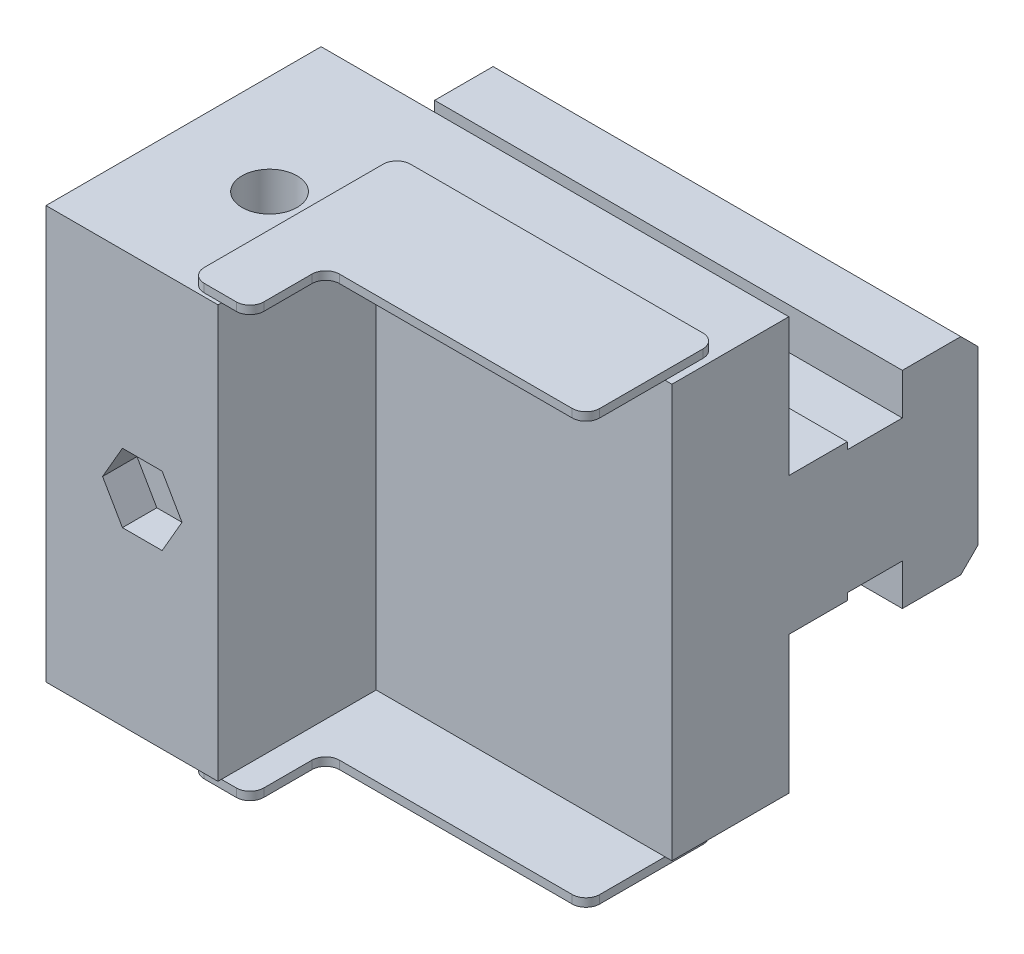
ISO-10303-21;
HEADER;
FILE_DESCRIPTION(('STEP AP214'),'2;1');
FILE_NAME('part.step','',(''),(''),'','','');
FILE_SCHEMA(('AUTOMOTIVE_DESIGN { 1 0 10303 214 1 1 1 1 }'));
ENDSEC;
DATA;
#1=APPLICATION_CONTEXT('core data for automotive mechanical design processes');
#2=APPLICATION_PROTOCOL_DEFINITION('international standard','automotive_design',2000,#1);
#3=PRODUCT_CONTEXT('',#1,'mechanical');
#4=PRODUCT('Part','Part','',(#3));
#5=PRODUCT_RELATED_PRODUCT_CATEGORY('part','',(#4));
#6=PRODUCT_DEFINITION_FORMATION('','',#4);
#7=PRODUCT_DEFINITION_CONTEXT('part definition',#1,'design');
#8=PRODUCT_DEFINITION('design','',#6,#7);
#9=PRODUCT_DEFINITION_SHAPE('','',#8);
#10=(LENGTH_UNIT() NAMED_UNIT(*) SI_UNIT(.MILLI.,.METRE.));
#11=(NAMED_UNIT(*) PLANE_ANGLE_UNIT() SI_UNIT($,.RADIAN.));
#12=(NAMED_UNIT(*) SI_UNIT($,.STERADIAN.) SOLID_ANGLE_UNIT());
#13=UNCERTAINTY_MEASURE_WITH_UNIT(LENGTH_MEASURE(1.E-05),#10,'distance_accuracy_value','');
#14=(GEOMETRIC_REPRESENTATION_CONTEXT(3) GLOBAL_UNCERTAINTY_ASSIGNED_CONTEXT((#13)) GLOBAL_UNIT_ASSIGNED_CONTEXT((#10,
#11,#12)) REPRESENTATION_CONTEXT('',''));
#15=CARTESIAN_POINT('',(0.,0.,0.));
#16=DIRECTION('',(0.,0.,1.));
#17=DIRECTION('',(1.,0.,0.));
#18=AXIS2_PLACEMENT_3D('',#15,#16,#17);
#19=CARTESIAN_POINT('',(25.000273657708,40.,40.));
#20=DIRECTION('',(0.,0.,-1.));
#21=DIRECTION('',(-1.,0.,0.));
#22=AXIS2_PLACEMENT_3D('',#19,#20,#21);
#23=PLANE('',#22);
#24=DIRECTION('',(-0.5,0.866025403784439,0.));
#25=VECTOR('',#24,1.);
#26=CARTESIAN_POINT('',(19.7735026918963,0.,40.));
#27=LINE('',#26,#25);
#28=CARTESIAN_POINT('',(19.7735026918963,0.,40.));
#29=VERTEX_POINT('',#28);
#30=CARTESIAN_POINT('',(16.8867513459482,5.,40.));
#31=VERTEX_POINT('',#30);
#32=EDGE_CURVE('E693',#29,#31,#27,.T.);
#33=ORIENTED_EDGE('',*,*,#32,.F.);
#34=DIRECTION('',(0.5,0.866025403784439,0.));
#35=VECTOR('',#34,1.);
#36=CARTESIAN_POINT('',(16.8867513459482,-5.,40.));
#37=LINE('',#36,#35);
#38=CARTESIAN_POINT('',(16.8867513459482,-5.,40.));
#39=VERTEX_POINT('',#38);
#40=EDGE_CURVE('E691',#39,#29,#37,.T.);
#41=ORIENTED_EDGE('',*,*,#40,.F.);
#42=DIRECTION('',(1.,0.,0.));
#43=VECTOR('',#42,1.);
#44=CARTESIAN_POINT('',(11.1132486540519,-5.,40.));
#45=LINE('',#44,#43);
#46=CARTESIAN_POINT('',(11.1132486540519,-5.,40.));
#47=VERTEX_POINT('',#46);
#48=EDGE_CURVE('E705',#47,#39,#45,.T.);
#49=ORIENTED_EDGE('',*,*,#48,.F.);
#50=DIRECTION('',(0.5,-0.866025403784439,0.));
#51=VECTOR('',#50,1.);
#52=CARTESIAN_POINT('',(8.22649730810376,0.,40.));
#53=LINE('',#52,#51);
#54=CARTESIAN_POINT('',(8.22649730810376,0.,40.));
#55=VERTEX_POINT('',#54);
#56=EDGE_CURVE('E702',#55,#47,#53,.T.);
#57=ORIENTED_EDGE('',*,*,#56,.F.);
#58=DIRECTION('',(-0.5,-0.866025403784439,0.));
#59=VECTOR('',#58,1.);
#60=CARTESIAN_POINT('',(11.1132486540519,5.,40.));
#61=LINE('',#60,#59);
#62=CARTESIAN_POINT('',(11.1132486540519,5.,40.));
#63=VERTEX_POINT('',#62);
#64=EDGE_CURVE('E699',#63,#55,#61,.T.);
#65=ORIENTED_EDGE('',*,*,#64,.F.);
#66=DIRECTION('',(-1.,0.,0.));
#67=VECTOR('',#66,1.);
#68=CARTESIAN_POINT('',(16.8867513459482,5.,40.));
#69=LINE('',#68,#67);
#70=EDGE_CURVE('E696',#31,#63,#69,.T.);
#71=ORIENTED_EDGE('',*,*,#70,.F.);
#72=EDGE_LOOP('',(#33,#41,#49,#57,#65,#71));
#73=FACE_BOUND('',#72,.T.);
#74=DIRECTION('',(-1.,0.,0.));
#75=VECTOR('',#74,1.);
#76=CARTESIAN_POINT('',(25.000273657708,-30.,40.));
#77=LINE('',#76,#75);
#78=CARTESIAN_POINT('',(25.,-30.,40.));
#79=VERTEX_POINT('',#78);
#80=CARTESIAN_POINT('',(0.,-30.,40.));
#81=VERTEX_POINT('',#80);
#82=EDGE_CURVE('E364',#79,#81,#77,.T.);
#83=ORIENTED_EDGE('',*,*,#82,.F.);
#84=DIRECTION('',(0.,-1.,0.));
#85=VECTOR('',#84,1.);
#86=CARTESIAN_POINT('',(25.,30.,40.));
#87=LINE('',#86,#85);
#88=CARTESIAN_POINT('',(25.,30.,40.));
#89=VERTEX_POINT('',#88);
#90=EDGE_CURVE('E361',#89,#79,#87,.T.);
#91=ORIENTED_EDGE('',*,*,#90,.F.);
#92=DIRECTION('',(1.,0.,0.));
#93=VECTOR('',#92,1.);
#94=CARTESIAN_POINT('',(0.,30.,40.));
#95=LINE('',#94,#93);
#96=CARTESIAN_POINT('',(0.,30.,40.));
#97=VERTEX_POINT('',#96);
#98=EDGE_CURVE('E347',#97,#89,#95,.T.);
#99=ORIENTED_EDGE('',*,*,#98,.F.);
#100=DIRECTION('',(0.,-1.,0.));
#101=VECTOR('',#100,1.);
#102=CARTESIAN_POINT('',(0.,40.,40.));
#103=LINE('',#102,#101);
#104=EDGE_CURVE('E637',#97,#81,#103,.T.);
#105=ORIENTED_EDGE('',*,*,#104,.T.);
#106=EDGE_LOOP('',(#83,#91,#99,#105));
#107=FACE_BOUND('',#106,.T.);
#108=ADVANCED_FACE('F14',(#73,#107),#23,.F.);
#109=CARTESIAN_POINT('',(65.0026136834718,-30.,11.4953296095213));
#110=DIRECTION('',(0.,-1.,0.));
#111=DIRECTION('',(0.,0.,-1.));
#112=AXIS2_PLACEMENT_3D('',#109,#110,#111);
#113=PLANE('',#112);
#114=CARTESIAN_POINT('',(14.5,-30.,22.));
#115=DIRECTION('',(0.,-1.,0.));
#116=DIRECTION('',(0.,0.,-1.));
#117=AXIS2_PLACEMENT_3D('',#114,#115,#116);
#118=CIRCLE('',#117,4.);
#119=CARTESIAN_POINT('',(14.5,-30.,18.));
#120=VERTEX_POINT('',#119);
#121=EDGE_CURVE('E555',#120,#120,#118,.F.);
#122=ORIENTED_EDGE('',*,*,#121,.T.);
#123=EDGE_LOOP('',(#122));
#124=FACE_BOUND('',#123,.T.);
#125=CARTESIAN_POINT('',(22.5009829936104,-30.,37.4953891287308));
#126=DIRECTION('',(0.,1.,0.));
#127=DIRECTION('',(0.,0.,-1.));
#128=AXIS2_PLACEMENT_3D('',#125,#126,#127);
#129=CIRCLE('',#128,2.);
#130=CARTESIAN_POINT('',(20.5009829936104,-30.,37.4953891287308));
#131=VERTEX_POINT('',#130);
#132=CARTESIAN_POINT('',(22.5009829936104,-30.,39.4953891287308));
#133=VERTEX_POINT('',#132);
#134=EDGE_CURVE('E549',#131,#133,#129,.T.);
#135=ORIENTED_EDGE('',*,*,#134,.T.);
#136=DIRECTION('',(1.,0.,0.));
#137=VECTOR('',#136,1.);
#138=CARTESIAN_POINT('',(22.5009829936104,-30.,39.4953891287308));
#139=LINE('',#138,#137);
#140=CARTESIAN_POINT('',(25.,-30.,39.4953891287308));
#141=VERTEX_POINT('',#140);
#142=EDGE_CURVE('E552',#133,#141,#139,.T.);
#143=ORIENTED_EDGE('',*,*,#142,.T.);
#144=DIRECTION('',(0.,0.,-1.));
#145=VECTOR('',#144,1.);
#146=CARTESIAN_POINT('',(25.,-30.,40.));
#147=LINE('',#146,#145);
#148=EDGE_CURVE('E367',#79,#141,#147,.T.);
#149=ORIENTED_EDGE('',*,*,#148,.F.);
#150=ORIENTED_EDGE('',*,*,#82,.T.);
#151=DIRECTION('',(0.,0.,-1.));
#152=VECTOR('',#151,1.);
#153=CARTESIAN_POINT('',(0.,-30.,40.));
#154=LINE('',#153,#152);
#155=CARTESIAN_POINT('',(0.,-30.,0.));
#156=VERTEX_POINT('',#155);
#157=EDGE_CURVE('E528',#81,#156,#154,.T.);
#158=ORIENTED_EDGE('',*,*,#157,.T.);
#159=DIRECTION('',(1.,0.,0.));
#160=VECTOR('',#159,1.);
#161=CARTESIAN_POINT('',(0.,-30.,0.));
#162=LINE('',#161,#160);
#163=CARTESIAN_POINT('',(68.,-30.,0.));
#164=VERTEX_POINT('',#163);
#165=EDGE_CURVE('E530',#156,#164,#162,.T.);
#166=ORIENTED_EDGE('',*,*,#165,.T.);
#167=DIRECTION('',(0.,0.,-1.));
#168=VECTOR('',#167,1.);
#169=CARTESIAN_POINT('',(68.,-30.,11.4953296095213));
#170=LINE('',#169,#168);
#171=CARTESIAN_POINT('',(68.,-30.,17.));
#172=VERTEX_POINT('',#171);
#173=EDGE_CURVE('E379',#172,#164,#170,.T.);
#174=ORIENTED_EDGE('',*,*,#173,.F.);
#175=DIRECTION('',(-1.,0.,0.));
#176=VECTOR('',#175,1.);
#177=CARTESIAN_POINT('',(25.,-30.,17.));
#178=LINE('',#177,#176);
#179=CARTESIAN_POINT('',(67.0026136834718,-30.,17.));
#180=VERTEX_POINT('',#179);
#181=EDGE_CURVE('E422',#172,#180,#178,.T.);
#182=ORIENTED_EDGE('',*,*,#181,.T.);
#183=DIRECTION('',(0.,0.,-1.));
#184=VECTOR('',#183,1.);
#185=CARTESIAN_POINT('',(67.0026136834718,-30.,17.0012588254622));
#186=LINE('',#185,#184);
#187=CARTESIAN_POINT('',(67.0026136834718,-30.,11.4953296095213));
#188=VERTEX_POINT('',#187);
#189=EDGE_CURVE('E533',#180,#188,#186,.T.);
#190=ORIENTED_EDGE('',*,*,#189,.T.);
#191=CARTESIAN_POINT('',(65.0026136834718,-30.,11.4953296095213));
#192=DIRECTION('',(0.,1.,0.));
#193=DIRECTION('',(0.,0.,-1.));
#194=AXIS2_PLACEMENT_3D('',#191,#192,#193);
#195=CIRCLE('',#194,2.);
#196=CARTESIAN_POINT('',(65.0026136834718,-30.,9.4953296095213));
#197=VERTEX_POINT('',#196);
#198=EDGE_CURVE('E537',#188,#197,#195,.T.);
#199=ORIENTED_EDGE('',*,*,#198,.T.);
#200=DIRECTION('',(-1.,0.,0.));
#201=VECTOR('',#200,1.);
#202=CARTESIAN_POINT('',(65.0026136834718,-30.,9.49532960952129));
#203=LINE('',#202,#201);
#204=CARTESIAN_POINT('',(22.5009829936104,-30.,9.49532960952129));
#205=VERTEX_POINT('',#204);
#206=EDGE_CURVE('E540',#197,#205,#203,.T.);
#207=ORIENTED_EDGE('',*,*,#206,.T.);
#208=CARTESIAN_POINT('',(22.5009829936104,-30.,11.4953296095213));
#209=DIRECTION('',(0.,1.,0.));
#210=DIRECTION('',(0.,0.,-1.));
#211=AXIS2_PLACEMENT_3D('',#208,#209,#210);
#212=CIRCLE('',#211,2.);
#213=CARTESIAN_POINT('',(20.5009829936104,-30.,11.4953296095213));
#214=VERTEX_POINT('',#213);
#215=EDGE_CURVE('E543',#205,#214,#212,.T.);
#216=ORIENTED_EDGE('',*,*,#215,.T.);
#217=DIRECTION('',(0.,0.,1.));
#218=VECTOR('',#217,1.);
#219=CARTESIAN_POINT('',(20.5009829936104,-30.,11.4953296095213));
#220=LINE('',#219,#218);
#221=EDGE_CURVE('E546',#214,#131,#220,.T.);
#222=ORIENTED_EDGE('',*,*,#221,.T.);
#223=EDGE_LOOP('',(#135,#143,#149,#150,#158,#166,#174,#182,#190,#199,#207,#216,#222));
#224=FACE_BOUND('',#223,.T.);
#225=ADVANCED_FACE('F772',(#124,#224),#113,.T.);
#226=CARTESIAN_POINT('',(22.5009829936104,30.,37.4953891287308));
#227=DIRECTION('',(0.,1.,0.));
#228=DIRECTION('',(0.,0.,1.));
#229=AXIS2_PLACEMENT_3D('',#226,#227,#228);
#230=PLANE('',#229);
#231=ORIENTED_EDGE('',*,*,#98,.T.);
#232=DIRECTION('',(0.,0.,1.));
#233=VECTOR('',#232,1.);
#234=CARTESIAN_POINT('',(25.,30.,39.4316267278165));
#235=LINE('',#234,#233);
#236=CARTESIAN_POINT('',(25.,30.,39.4953891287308));
#237=VERTEX_POINT('',#236);
#238=EDGE_CURVE('E350',#237,#89,#235,.T.);
#239=ORIENTED_EDGE('',*,*,#238,.F.);
#240=DIRECTION('',(-1.,0.,0.));
#241=VECTOR('',#240,1.);
#242=CARTESIAN_POINT('',(22.5009829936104,30.,39.4953891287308));
#243=LINE('',#242,#241);
#244=CARTESIAN_POINT('',(22.5009829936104,30.,39.4953891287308));
#245=VERTEX_POINT('',#244);
#246=EDGE_CURVE('E372',#237,#245,#243,.T.);
#247=ORIENTED_EDGE('',*,*,#246,.T.);
#248=CARTESIAN_POINT('',(22.5009829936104,30.,37.4953891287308));
#249=DIRECTION('',(0.,-1.,0.));
#250=DIRECTION('',(0.,0.,1.));
#251=AXIS2_PLACEMENT_3D('',#248,#249,#250);
#252=CIRCLE('',#251,2.);
#253=CARTESIAN_POINT('',(20.5009829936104,30.,37.4953891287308));
#254=VERTEX_POINT('',#253);
#255=EDGE_CURVE('E508',#245,#254,#252,.T.);
#256=ORIENTED_EDGE('',*,*,#255,.T.);
#257=DIRECTION('',(0.,0.,-1.));
#258=VECTOR('',#257,1.);
#259=CARTESIAN_POINT('',(20.5009829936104,30.,37.4953891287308));
#260=LINE('',#259,#258);
#261=CARTESIAN_POINT('',(20.5009829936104,30.,11.4953296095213));
#262=VERTEX_POINT('',#261);
#263=EDGE_CURVE('E510',#254,#262,#260,.T.);
#264=ORIENTED_EDGE('',*,*,#263,.T.);
#265=CARTESIAN_POINT('',(22.5009829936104,30.,11.4953296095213));
#266=DIRECTION('',(0.,-1.,0.));
#267=DIRECTION('',(0.,0.,1.));
#268=AXIS2_PLACEMENT_3D('',#265,#266,#267);
#269=CIRCLE('',#268,2.);
#270=CARTESIAN_POINT('',(22.5009829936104,30.,9.4953296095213));
#271=VERTEX_POINT('',#270);
#272=EDGE_CURVE('E513',#262,#271,#269,.T.);
#273=ORIENTED_EDGE('',*,*,#272,.T.);
#274=DIRECTION('',(1.,0.,0.));
#275=VECTOR('',#274,1.);
#276=CARTESIAN_POINT('',(22.5009829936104,30.,9.49532960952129));
#277=LINE('',#276,#275);
#278=CARTESIAN_POINT('',(65.0026136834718,30.,9.49532960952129));
#279=VERTEX_POINT('',#278);
#280=EDGE_CURVE('E516',#271,#279,#277,.T.);
#281=ORIENTED_EDGE('',*,*,#280,.T.);
#282=CARTESIAN_POINT('',(65.0026136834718,30.,11.4953296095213));
#283=DIRECTION('',(0.,-1.,0.));
#284=DIRECTION('',(0.,0.,1.));
#285=AXIS2_PLACEMENT_3D('',#282,#283,#284);
#286=CIRCLE('',#285,2.);
#287=CARTESIAN_POINT('',(67.0026136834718,30.,11.4953296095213));
#288=VERTEX_POINT('',#287);
#289=EDGE_CURVE('E519',#279,#288,#286,.T.);
#290=ORIENTED_EDGE('',*,*,#289,.T.);
#291=DIRECTION('',(0.,0.,1.));
#292=VECTOR('',#291,1.);
#293=CARTESIAN_POINT('',(67.0026136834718,30.,11.4953296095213));
#294=LINE('',#293,#292);
#295=CARTESIAN_POINT('',(67.0026136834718,30.,17.));
#296=VERTEX_POINT('',#295);
#297=EDGE_CURVE('E523',#288,#296,#294,.T.);
#298=ORIENTED_EDGE('',*,*,#297,.T.);
#299=DIRECTION('',(-1.,0.,0.));
#300=VECTOR('',#299,1.);
#301=CARTESIAN_POINT('',(22.5009829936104,30.,17.));
#302=LINE('',#301,#300);
#303=CARTESIAN_POINT('',(68.,30.,17.));
#304=VERTEX_POINT('',#303);
#305=EDGE_CURVE('E23',#304,#296,#302,.T.);
#306=ORIENTED_EDGE('',*,*,#305,.F.);
#307=DIRECTION('',(0.,0.,1.));
#308=VECTOR('',#307,1.);
#309=CARTESIAN_POINT('',(68.,30.,37.4953891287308));
#310=LINE('',#309,#308);
#311=CARTESIAN_POINT('',(68.,30.,0.));
#312=VERTEX_POINT('',#311);
#313=EDGE_CURVE('E377',#312,#304,#310,.T.);
#314=ORIENTED_EDGE('',*,*,#313,.F.);
#315=DIRECTION('',(-1.,0.,0.));
#316=VECTOR('',#315,1.);
#317=CARTESIAN_POINT('',(68.0003831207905,30.,0.));
#318=LINE('',#317,#316);
#319=CARTESIAN_POINT('',(0.,30.,0.));
#320=VERTEX_POINT('',#319);
#321=EDGE_CURVE('E503',#312,#320,#318,.T.);
#322=ORIENTED_EDGE('',*,*,#321,.T.);
#323=DIRECTION('',(0.,0.,1.));
#324=VECTOR('',#323,1.);
#325=CARTESIAN_POINT('',(0.,30.,0.));
#326=LINE('',#325,#324);
#327=EDGE_CURVE('E352',#320,#97,#326,.T.);
#328=ORIENTED_EDGE('',*,*,#327,.T.);
#329=EDGE_LOOP('',(#231,#239,#247,#256,#264,#273,#281,#290,#298,#306,#314,#322,#328));
#330=FACE_BOUND('',#329,.T.);
#331=CARTESIAN_POINT('',(14.5,30.,22.));
#332=DIRECTION('',(0.,1.,0.));
#333=DIRECTION('',(0.,0.,1.));
#334=AXIS2_PLACEMENT_3D('',#331,#332,#333);
#335=CIRCLE('',#334,4.);
#336=CARTESIAN_POINT('',(14.5,30.,26.));
#337=VERTEX_POINT('',#336);
#338=EDGE_CURVE('E526',#337,#337,#335,.F.);
#339=ORIENTED_EDGE('',*,*,#338,.T.);
#340=EDGE_LOOP('',(#339));
#341=FACE_BOUND('',#340,.T.);
#342=ADVANCED_FACE('F348',(#330,#341),#230,.T.);
#343=CARTESIAN_POINT('',(22.5009829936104,41.2,39.4953891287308));
#344=DIRECTION('',(0.,0.,-1.));
#345=DIRECTION('',(-1.,0.,0.));
#346=AXIS2_PLACEMENT_3D('',#343,#344,#345);
#347=PLANE('',#346);
#348=DIRECTION('',(0.,-1.,0.));
#349=VECTOR('',#348,1.);
#350=CARTESIAN_POINT('',(27.1609829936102,41.2,39.4953891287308));
#351=LINE('',#350,#349);
#352=CARTESIAN_POINT('',(27.1609829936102,-30.,39.4953891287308));
#353=VERTEX_POINT('',#352);
#354=CARTESIAN_POINT('',(27.1609829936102,-31.2,39.4953891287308));
#355=VERTEX_POINT('',#354);
#356=EDGE_CURVE('E679',#353,#355,#351,.T.);
#357=ORIENTED_EDGE('',*,*,#356,.F.);
#358=EDGE_CURVE('E551',#141,#353,#139,.T.);
#359=ORIENTED_EDGE('',*,*,#358,.F.);
#360=ORIENTED_EDGE('',*,*,#142,.F.);
#361=DIRECTION('',(0.,1.,0.));
#362=VECTOR('',#361,1.);
#363=CARTESIAN_POINT('',(22.5009829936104,-41.2,39.4953891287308));
#364=LINE('',#363,#362);
#365=CARTESIAN_POINT('',(22.5009829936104,-31.2,39.4953891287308));
#366=VERTEX_POINT('',#365);
#367=EDGE_CURVE('E643',#366,#133,#364,.T.);
#368=ORIENTED_EDGE('',*,*,#367,.F.);
#369=DIRECTION('',(-1.,0.,0.));
#370=VECTOR('',#369,1.);
#371=CARTESIAN_POINT('',(27.1609829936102,-31.2,39.4953891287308));
#372=LINE('',#371,#370);
#373=EDGE_CURVE('E497',#355,#366,#372,.T.);
#374=ORIENTED_EDGE('',*,*,#373,.F.);
#375=EDGE_LOOP('',(#357,#359,#360,#368,#374));
#376=FACE_BOUND('',#375,.T.);
#377=ADVANCED_FACE('F783',(#376),#347,.F.);
#378=CARTESIAN_POINT('',(27.1609829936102,41.2,37.4953891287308));
#379=DIRECTION('',(0.,-1.,0.));
#380=DIRECTION('',(1.,0.,0.));
#381=AXIS2_PLACEMENT_3D('',#378,#379,#380);
#382=CYLINDRICAL_SURFACE('',#381,2.);
#383=CARTESIAN_POINT('',(27.1609829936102,-30.,37.4953891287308));
#384=DIRECTION('',(0.,1.,0.));
#385=DIRECTION('',(0.,0.,1.));
#386=AXIS2_PLACEMENT_3D('',#383,#384,#385);
#387=CIRCLE('',#386,2.);
#388=CARTESIAN_POINT('',(29.1609829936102,-30.,37.4953891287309));
#389=VERTEX_POINT('',#388);
#390=EDGE_CURVE('E438',#353,#389,#387,.T.);
#391=ORIENTED_EDGE('',*,*,#390,.F.);
#392=ORIENTED_EDGE('',*,*,#356,.T.);
#393=CARTESIAN_POINT('',(27.1609829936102,-31.2,37.4953891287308));
#394=DIRECTION('',(0.,-1.,0.));
#395=DIRECTION('',(0.,0.,-1.));
#396=AXIS2_PLACEMENT_3D('',#393,#394,#395);
#397=CIRCLE('',#396,2.);
#398=CARTESIAN_POINT('',(29.1609829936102,-31.2,37.4953891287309));
#399=VERTEX_POINT('',#398);
#400=EDGE_CURVE('E494',#399,#355,#397,.T.);
#401=ORIENTED_EDGE('',*,*,#400,.F.);
#402=DIRECTION('',(0.,-1.,0.));
#403=VECTOR('',#402,1.);
#404=CARTESIAN_POINT('',(29.1609829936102,41.2,37.4953891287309));
#405=LINE('',#404,#403);
#406=EDGE_CURVE('E675',#389,#399,#405,.T.);
#407=ORIENTED_EDGE('',*,*,#406,.F.);
#408=EDGE_LOOP('',(#391,#392,#401,#407));
#409=FACE_BOUND('',#408,.T.);
#410=ADVANCED_FACE('F912',(#409),#382,.T.);
#411=CARTESIAN_POINT('',(29.1609829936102,41.2,37.4953891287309));
#412=DIRECTION('',(-1.,0.,-1.26898060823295E-13));
#413=DIRECTION('',(-1.26898060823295E-13,0.,1.));
#414=AXIS2_PLACEMENT_3D('',#411,#412,#413);
#415=PLANE('',#414);
#416=DIRECTION('',(1.26898060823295E-13,0.,-1.));
#417=VECTOR('',#416,1.);
#418=CARTESIAN_POINT('',(29.1609829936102,-30.,37.4953891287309));
#419=LINE('',#418,#417);
#420=CARTESIAN_POINT('',(29.1609829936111,-30.,30.4962402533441));
#421=VERTEX_POINT('',#420);
#422=EDGE_CURVE('E440',#389,#421,#419,.T.);
#423=ORIENTED_EDGE('',*,*,#422,.F.);
#424=ORIENTED_EDGE('',*,*,#406,.T.);
#425=DIRECTION('',(-1.28385147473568E-13,0.,1.));
#426=VECTOR('',#425,1.);
#427=CARTESIAN_POINT('',(29.1609829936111,-31.2,30.4962402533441));
#428=LINE('',#427,#426);
#429=CARTESIAN_POINT('',(29.1609829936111,-31.2,30.4962402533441));
#430=VERTEX_POINT('',#429);
#431=EDGE_CURVE('E491',#430,#399,#428,.T.);
#432=ORIENTED_EDGE('',*,*,#431,.F.);
#433=DIRECTION('',(0.,-1.,0.));
#434=VECTOR('',#433,1.);
#435=CARTESIAN_POINT('',(29.1609829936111,41.2,30.4962402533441));
#436=LINE('',#435,#434);
#437=EDGE_CURVE('E671',#421,#430,#436,.T.);
#438=ORIENTED_EDGE('',*,*,#437,.F.);
#439=EDGE_LOOP('',(#423,#424,#432,#438));
#440=FACE_BOUND('',#439,.T.);
#441=ADVANCED_FACE('F907',(#440),#415,.F.);
#442=CARTESIAN_POINT('',(31.1609829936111,41.2,30.4962402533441));
#443=DIRECTION('',(0.,-1.,0.));
#444=DIRECTION('',(1.,0.,0.));
#445=AXIS2_PLACEMENT_3D('',#442,#443,#444);
#446=CYLINDRICAL_SURFACE('',#445,2.);
#447=CARTESIAN_POINT('',(31.1609829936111,-30.,30.4962402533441));
#448=DIRECTION('',(0.,1.,0.));
#449=DIRECTION('',(0.,0.,1.));
#450=AXIS2_PLACEMENT_3D('',#447,#448,#449);
#451=CIRCLE('',#450,2.);
#452=CARTESIAN_POINT('',(31.1609829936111,-30.,28.4962402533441));
#453=VERTEX_POINT('',#452);
#454=EDGE_CURVE('E442',#421,#453,#451,.F.);
#455=ORIENTED_EDGE('',*,*,#454,.F.);
#456=ORIENTED_EDGE('',*,*,#437,.T.);
#457=CARTESIAN_POINT('',(31.1609829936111,-31.2,30.4962402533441));
#458=DIRECTION('',(0.,1.,0.));
#459=DIRECTION('',(0.,0.,-1.));
#460=AXIS2_PLACEMENT_3D('',#457,#458,#459);
#461=CIRCLE('',#460,2.);
#462=CARTESIAN_POINT('',(31.1609829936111,-31.2,28.4962402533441));
#463=VERTEX_POINT('',#462);
#464=EDGE_CURVE('E488',#463,#430,#461,.T.);
#465=ORIENTED_EDGE('',*,*,#464,.F.);
#466=DIRECTION('',(0.,-1.,0.));
#467=VECTOR('',#466,1.);
#468=CARTESIAN_POINT('',(31.1609829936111,41.2,28.4962402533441));
#469=LINE('',#468,#467);
#470=EDGE_CURVE('E667',#453,#463,#469,.T.);
#471=ORIENTED_EDGE('',*,*,#470,.F.);
#472=EDGE_LOOP('',(#455,#456,#465,#471));
#473=FACE_BOUND('',#472,.T.);
#474=ADVANCED_FACE('F902',(#473),#446,.F.);
#475=CARTESIAN_POINT('',(65.0026136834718,41.2,28.4962402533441));
#476=DIRECTION('',(0.,0.,-1.));
#477=DIRECTION('',(-1.,0.,0.));
#478=AXIS2_PLACEMENT_3D('',#475,#476,#477);
#479=PLANE('',#478);
#480=DIRECTION('',(1.,0.,0.));
#481=VECTOR('',#480,1.);
#482=CARTESIAN_POINT('',(65.0026136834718,-30.,28.4962402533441));
#483=LINE('',#482,#481);
#484=CARTESIAN_POINT('',(65.0026136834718,-30.,28.4962402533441));
#485=VERTEX_POINT('',#484);
#486=EDGE_CURVE('E444',#453,#485,#483,.T.);
#487=ORIENTED_EDGE('',*,*,#486,.F.);
#488=ORIENTED_EDGE('',*,*,#470,.T.);
#489=DIRECTION('',(-1.,0.,0.));
#490=VECTOR('',#489,1.);
#491=CARTESIAN_POINT('',(65.0026136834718,-31.2,28.4962402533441));
#492=LINE('',#491,#490);
#493=CARTESIAN_POINT('',(65.0026136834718,-31.2,28.4962402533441));
#494=VERTEX_POINT('',#493);
#495=EDGE_CURVE('E485',#494,#463,#492,.T.);
#496=ORIENTED_EDGE('',*,*,#495,.F.);
#497=DIRECTION('',(0.,-1.,0.));
#498=VECTOR('',#497,1.);
#499=CARTESIAN_POINT('',(65.0026136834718,41.2,28.4962402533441));
#500=LINE('',#499,#498);
#501=EDGE_CURVE('E663',#485,#494,#500,.T.);
#502=ORIENTED_EDGE('',*,*,#501,.F.);
#503=EDGE_LOOP('',(#487,#488,#496,#502));
#504=FACE_BOUND('',#503,.T.);
#505=ADVANCED_FACE('F897',(#504),#479,.F.);
#506=CARTESIAN_POINT('',(65.0026136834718,41.2,26.4962402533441));
#507=DIRECTION('',(0.,-1.,0.));
#508=DIRECTION('',(1.,0.,0.));
#509=AXIS2_PLACEMENT_3D('',#506,#507,#508);
#510=CYLINDRICAL_SURFACE('',#509,2.);
#511=CARTESIAN_POINT('',(65.0026136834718,-30.,26.4962402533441));
#512=DIRECTION('',(0.,1.,0.));
#513=DIRECTION('',(0.,0.,1.));
#514=AXIS2_PLACEMENT_3D('',#511,#512,#513);
#515=CIRCLE('',#514,2.);
#516=CARTESIAN_POINT('',(67.0026136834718,-30.,26.4962402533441));
#517=VERTEX_POINT('',#516);
#518=EDGE_CURVE('E446',#485,#517,#515,.T.);
#519=ORIENTED_EDGE('',*,*,#518,.F.);
#520=ORIENTED_EDGE('',*,*,#501,.T.);
#521=CARTESIAN_POINT('',(65.0026136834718,-31.2,26.4962402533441));
#522=DIRECTION('',(0.,-1.,0.));
#523=DIRECTION('',(0.,0.,-1.));
#524=AXIS2_PLACEMENT_3D('',#521,#522,#523);
#525=CIRCLE('',#524,2.);
#526=CARTESIAN_POINT('',(67.0026136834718,-31.2,26.4962402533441));
#527=VERTEX_POINT('',#526);
#528=EDGE_CURVE('E482',#527,#494,#525,.T.);
#529=ORIENTED_EDGE('',*,*,#528,.F.);
#530=DIRECTION('',(0.,-1.,0.));
#531=VECTOR('',#530,1.);
#532=CARTESIAN_POINT('',(67.0026136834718,41.2,26.4962402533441));
#533=LINE('',#532,#531);
#534=EDGE_CURVE('E659',#517,#527,#533,.T.);
#535=ORIENTED_EDGE('',*,*,#534,.F.);
#536=EDGE_LOOP('',(#519,#520,#529,#535));
#537=FACE_BOUND('',#536,.T.);
#538=ADVANCED_FACE('F892',(#537),#510,.T.);
#539=CARTESIAN_POINT('',(67.0026136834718,41.2,11.4953296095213));
#540=DIRECTION('',(-1.,0.,0.));
#541=DIRECTION('',(0.,-1.,0.));
#542=AXIS2_PLACEMENT_3D('',#539,#540,#541);
#543=PLANE('',#542);
#544=EDGE_CURVE('E534',#517,#180,#186,.T.);
#545=ORIENTED_EDGE('',*,*,#544,.F.);
#546=ORIENTED_EDGE('',*,*,#534,.T.);
#547=DIRECTION('',(0.,0.,1.));
#548=VECTOR('',#547,1.);
#549=CARTESIAN_POINT('',(67.0026136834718,-31.2,11.4953296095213));
#550=LINE('',#549,#548);
#551=CARTESIAN_POINT('',(67.0026136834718,-31.2,11.4953296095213));
#552=VERTEX_POINT('',#551);
#553=EDGE_CURVE('E479',#552,#527,#550,.T.);
#554=ORIENTED_EDGE('',*,*,#553,.F.);
#555=DIRECTION('',(0.,1.,0.));
#556=VECTOR('',#555,1.);
#557=CARTESIAN_POINT('',(67.0026136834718,-41.2,11.4953296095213));
#558=LINE('',#557,#556);
#559=EDGE_CURVE('E646',#552,#188,#558,.T.);
#560=ORIENTED_EDGE('',*,*,#559,.T.);
#561=ORIENTED_EDGE('',*,*,#189,.F.);
#562=EDGE_LOOP('',(#545,#546,#554,#560,#561));
#563=FACE_BOUND('',#562,.T.);
#564=ADVANCED_FACE('F887',(#563),#543,.F.);
#565=DIRECTION('',(-1.,0.,0.));
#566=VECTOR('',#565,1.);
#567=CARTESIAN_POINT('',(25.000273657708,30.,39.4953891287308));
#568=LINE('',#567,#566);
#569=CARTESIAN_POINT('',(27.1609829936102,30.,39.4953891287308));
#570=VERTEX_POINT('',#569);
#571=EDGE_CURVE('E357',#570,#237,#568,.T.);
#572=ORIENTED_EDGE('',*,*,#571,.F.);
#573=CARTESIAN_POINT('',(27.1609829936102,31.2,39.4953891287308));
#574=VERTEX_POINT('',#573);
#575=EDGE_CURVE('E680',#574,#570,#351,.T.);
#576=ORIENTED_EDGE('',*,*,#575,.F.);
#577=DIRECTION('',(1.,0.,0.));
#578=VECTOR('',#577,1.);
#579=CARTESIAN_POINT('',(22.5009829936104,31.2,39.4953891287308));
#580=LINE('',#579,#578);
#581=CARTESIAN_POINT('',(22.5009829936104,31.2,39.4953891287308));
#582=VERTEX_POINT('',#581);
#583=EDGE_CURVE('E455',#582,#574,#580,.T.);
#584=ORIENTED_EDGE('',*,*,#583,.F.);
#585=DIRECTION('',(0.,-1.,0.));
#586=VECTOR('',#585,1.);
#587=CARTESIAN_POINT('',(22.5009829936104,41.2,39.4953891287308));
#588=LINE('',#587,#586);
#589=EDGE_CURVE('E683',#582,#245,#588,.T.);
#590=ORIENTED_EDGE('',*,*,#589,.T.);
#591=ORIENTED_EDGE('',*,*,#246,.F.);
#592=EDGE_LOOP('',(#572,#576,#584,#590,#591));
#593=FACE_BOUND('',#592,.T.);
#594=ADVANCED_FACE('F910',(#593),#347,.F.);
#595=ORIENTED_EDGE('',*,*,#575,.T.);
#596=CARTESIAN_POINT('',(27.1609829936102,30.,37.4953891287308));
#597=DIRECTION('',(0.,1.,0.));
#598=DIRECTION('',(0.,0.,1.));
#599=AXIS2_PLACEMENT_3D('',#596,#597,#598);
#600=CIRCLE('',#599,2.);
#601=CARTESIAN_POINT('',(29.1609829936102,30.,37.4953891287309));
#602=VERTEX_POINT('',#601);
#603=EDGE_CURVE('E423',#570,#602,#600,.T.);
#604=ORIENTED_EDGE('',*,*,#603,.T.);
#605=CARTESIAN_POINT('',(29.1609829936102,31.2,37.4953891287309));
#606=VERTEX_POINT('',#605);
#607=EDGE_CURVE('E676',#606,#602,#405,.T.);
#608=ORIENTED_EDGE('',*,*,#607,.F.);
#609=CARTESIAN_POINT('',(27.1609829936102,31.2,37.4953891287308));
#610=DIRECTION('',(0.,1.,0.));
#611=DIRECTION('',(0.,0.,1.));
#612=AXIS2_PLACEMENT_3D('',#609,#610,#611);
#613=CIRCLE('',#612,2.);
#614=EDGE_CURVE('E457',#574,#606,#613,.T.);
#615=ORIENTED_EDGE('',*,*,#614,.F.);
#616=EDGE_LOOP('',(#595,#604,#608,#615));
#617=FACE_BOUND('',#616,.T.);
#618=ADVANCED_FACE('F905',(#617),#382,.T.);
#619=ORIENTED_EDGE('',*,*,#607,.T.);
#620=DIRECTION('',(1.26898060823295E-13,0.,-1.));
#621=VECTOR('',#620,1.);
#622=CARTESIAN_POINT('',(29.1609829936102,30.,37.4953891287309));
#623=LINE('',#622,#621);
#624=CARTESIAN_POINT('',(29.1609829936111,30.,30.4962402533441));
#625=VERTEX_POINT('',#624);
#626=EDGE_CURVE('E426',#602,#625,#623,.T.);
#627=ORIENTED_EDGE('',*,*,#626,.T.);
#628=CARTESIAN_POINT('',(29.1609829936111,31.2,30.4962402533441));
#629=VERTEX_POINT('',#628);
#630=EDGE_CURVE('E672',#629,#625,#436,.T.);
#631=ORIENTED_EDGE('',*,*,#630,.F.);
#632=DIRECTION('',(1.28880843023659E-13,0.,-1.));
#633=VECTOR('',#632,1.);
#634=CARTESIAN_POINT('',(29.1609829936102,31.2,37.4953891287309));
#635=LINE('',#634,#633);
#636=EDGE_CURVE('E459',#606,#629,#635,.T.);
#637=ORIENTED_EDGE('',*,*,#636,.F.);
#638=EDGE_LOOP('',(#619,#627,#631,#637));
#639=FACE_BOUND('',#638,.T.);
#640=ADVANCED_FACE('F900',(#639),#415,.F.);
#641=ORIENTED_EDGE('',*,*,#630,.T.);
#642=CARTESIAN_POINT('',(31.1609829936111,30.,30.4962402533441));
#643=DIRECTION('',(0.,1.,0.));
#644=DIRECTION('',(0.,0.,1.));
#645=AXIS2_PLACEMENT_3D('',#642,#643,#644);
#646=CIRCLE('',#645,2.);
#647=CARTESIAN_POINT('',(31.1609829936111,30.,28.4962402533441));
#648=VERTEX_POINT('',#647);
#649=EDGE_CURVE('E429',#625,#648,#646,.F.);
#650=ORIENTED_EDGE('',*,*,#649,.T.);
#651=CARTESIAN_POINT('',(31.1609829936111,31.2,28.4962402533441));
#652=VERTEX_POINT('',#651);
#653=EDGE_CURVE('E668',#652,#648,#469,.T.);
#654=ORIENTED_EDGE('',*,*,#653,.F.);
#655=CARTESIAN_POINT('',(31.1609829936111,31.2,30.4962402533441));
#656=DIRECTION('',(0.,-1.,0.));
#657=DIRECTION('',(0.,0.,1.));
#658=AXIS2_PLACEMENT_3D('',#655,#656,#657);
#659=CIRCLE('',#658,2.);
#660=EDGE_CURVE('E461',#629,#652,#659,.T.);
#661=ORIENTED_EDGE('',*,*,#660,.F.);
#662=EDGE_LOOP('',(#641,#650,#654,#661));
#663=FACE_BOUND('',#662,.T.);
#664=ADVANCED_FACE('F895',(#663),#446,.F.);
#665=ORIENTED_EDGE('',*,*,#653,.T.);
#666=DIRECTION('',(1.,0.,0.));
#667=VECTOR('',#666,1.);
#668=CARTESIAN_POINT('',(65.0026136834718,30.,28.4962402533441));
#669=LINE('',#668,#667);
#670=CARTESIAN_POINT('',(65.0026136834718,30.,28.4962402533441));
#671=VERTEX_POINT('',#670);
#672=EDGE_CURVE('E432',#648,#671,#669,.T.);
#673=ORIENTED_EDGE('',*,*,#672,.T.);
#674=CARTESIAN_POINT('',(65.0026136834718,31.2,28.4962402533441));
#675=VERTEX_POINT('',#674);
#676=EDGE_CURVE('E664',#675,#671,#500,.T.);
#677=ORIENTED_EDGE('',*,*,#676,.F.);
#678=DIRECTION('',(1.,0.,0.));
#679=VECTOR('',#678,1.);
#680=CARTESIAN_POINT('',(31.1609829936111,31.2,28.4962402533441));
#681=LINE('',#680,#679);
#682=EDGE_CURVE('E463',#652,#675,#681,.T.);
#683=ORIENTED_EDGE('',*,*,#682,.F.);
#684=EDGE_LOOP('',(#665,#673,#677,#683));
#685=FACE_BOUND('',#684,.T.);
#686=ADVANCED_FACE('F890',(#685),#479,.F.);
#687=ORIENTED_EDGE('',*,*,#676,.T.);
#688=CARTESIAN_POINT('',(65.0026136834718,30.,26.4962402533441));
#689=DIRECTION('',(0.,1.,0.));
#690=DIRECTION('',(0.,0.,1.));
#691=AXIS2_PLACEMENT_3D('',#688,#689,#690);
#692=CIRCLE('',#691,2.);
#693=CARTESIAN_POINT('',(67.0026136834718,30.,26.4962402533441));
#694=VERTEX_POINT('',#693);
#695=EDGE_CURVE('E435',#671,#694,#692,.T.);
#696=ORIENTED_EDGE('',*,*,#695,.T.);
#697=CARTESIAN_POINT('',(67.0026136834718,31.2,26.4962402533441));
#698=VERTEX_POINT('',#697);
#699=EDGE_CURVE('E660',#698,#694,#533,.T.);
#700=ORIENTED_EDGE('',*,*,#699,.F.);
#701=CARTESIAN_POINT('',(65.0026136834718,31.2,26.4962402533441));
#702=DIRECTION('',(0.,1.,0.));
#703=DIRECTION('',(0.,0.,1.));
#704=AXIS2_PLACEMENT_3D('',#701,#702,#703);
#705=CIRCLE('',#704,2.);
#706=EDGE_CURVE('E465',#675,#698,#705,.T.);
#707=ORIENTED_EDGE('',*,*,#706,.F.);
#708=EDGE_LOOP('',(#687,#696,#700,#707));
#709=FACE_BOUND('',#708,.T.);
#710=ADVANCED_FACE('F885',(#709),#510,.T.);
#711=ORIENTED_EDGE('',*,*,#699,.T.);
#712=EDGE_CURVE('E522',#296,#694,#294,.T.);
#713=ORIENTED_EDGE('',*,*,#712,.F.);
#714=ORIENTED_EDGE('',*,*,#297,.F.);
#715=DIRECTION('',(0.,-1.,0.));
#716=VECTOR('',#715,1.);
#717=CARTESIAN_POINT('',(67.0026136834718,41.2,11.4953296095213));
#718=LINE('',#717,#716);
#719=CARTESIAN_POINT('',(67.0026136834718,31.2,11.4953296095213));
#720=VERTEX_POINT('',#719);
#721=EDGE_CURVE('E657',#720,#288,#718,.T.);
#722=ORIENTED_EDGE('',*,*,#721,.F.);
#723=DIRECTION('',(0.,0.,-1.));
#724=VECTOR('',#723,1.);
#725=CARTESIAN_POINT('',(67.0026136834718,31.2,26.4962402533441));
#726=LINE('',#725,#724);
#727=EDGE_CURVE('E467',#698,#720,#726,.T.);
#728=ORIENTED_EDGE('',*,*,#727,.F.);
#729=EDGE_LOOP('',(#711,#713,#714,#722,#728));
#730=FACE_BOUND('',#729,.T.);
#731=ADVANCED_FACE('F881',(#730),#543,.F.);
#732=CARTESIAN_POINT('',(22.5009829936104,41.2,11.4953296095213));
#733=DIRECTION('',(0.,-1.,0.));
#734=DIRECTION('',(1.,0.,0.));
#735=AXIS2_PLACEMENT_3D('',#732,#733,#734);
#736=CYLINDRICAL_SURFACE('',#735,2.);
#737=CARTESIAN_POINT('',(22.5009829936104,31.2,11.4953296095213));
#738=DIRECTION('',(0.,1.,0.));
#739=DIRECTION('',(0.,0.,1.));
#740=AXIS2_PLACEMENT_3D('',#737,#738,#739);
#741=CIRCLE('',#740,2.);
#742=CARTESIAN_POINT('',(22.5009829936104,31.2,9.49532960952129));
#743=VERTEX_POINT('',#742);
#744=CARTESIAN_POINT('',(20.5009829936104,31.2,11.4953296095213));
#745=VERTEX_POINT('',#744);
#746=EDGE_CURVE('E449',#743,#745,#741,.T.);
#747=ORIENTED_EDGE('',*,*,#746,.F.);
#748=DIRECTION('',(0.,-1.,0.));
#749=VECTOR('',#748,1.);
#750=CARTESIAN_POINT('',(22.5009829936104,41.2,9.49532960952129));
#751=LINE('',#750,#749);
#752=EDGE_CURVE('E653',#743,#271,#751,.T.);
#753=ORIENTED_EDGE('',*,*,#752,.T.);
#754=ORIENTED_EDGE('',*,*,#272,.F.);
#755=DIRECTION('',(0.,-1.,0.));
#756=VECTOR('',#755,1.);
#757=CARTESIAN_POINT('',(20.5009829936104,41.2,11.4953296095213));
#758=LINE('',#757,#756);
#759=EDGE_CURVE('E689',#745,#262,#758,.T.);
#760=ORIENTED_EDGE('',*,*,#759,.F.);
#761=EDGE_LOOP('',(#747,#753,#754,#760));
#762=FACE_BOUND('',#761,.T.);
#763=ADVANCED_FACE('F884',(#762),#736,.T.);
#764=CARTESIAN_POINT('',(20.5009829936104,41.2,37.4953891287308));
#765=DIRECTION('',(1.,0.,0.));
#766=DIRECTION('',(0.,1.,0.));
#767=AXIS2_PLACEMENT_3D('',#764,#765,#766);
#768=PLANE('',#767);
#769=DIRECTION('',(0.,0.,1.));
#770=VECTOR('',#769,1.);
#771=CARTESIAN_POINT('',(20.5009829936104,31.2,11.4953296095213));
#772=LINE('',#771,#770);
#773=CARTESIAN_POINT('',(20.5009829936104,31.2,37.4953891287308));
#774=VERTEX_POINT('',#773);
#775=EDGE_CURVE('E451',#745,#774,#772,.T.);
#776=ORIENTED_EDGE('',*,*,#775,.F.);
#777=ORIENTED_EDGE('',*,*,#759,.T.);
#778=ORIENTED_EDGE('',*,*,#263,.F.);
#779=DIRECTION('',(0.,-1.,0.));
#780=VECTOR('',#779,1.);
#781=CARTESIAN_POINT('',(20.5009829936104,41.2,37.4953891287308));
#782=LINE('',#781,#780);
#783=EDGE_CURVE('E686',#774,#254,#782,.T.);
#784=ORIENTED_EDGE('',*,*,#783,.F.);
#785=EDGE_LOOP('',(#776,#777,#778,#784));
#786=FACE_BOUND('',#785,.T.);
#787=ADVANCED_FACE('F918',(#786),#768,.F.);
#788=CARTESIAN_POINT('',(22.5009829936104,41.2,37.4953891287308));
#789=DIRECTION('',(0.,-1.,0.));
#790=DIRECTION('',(1.,0.,0.));
#791=AXIS2_PLACEMENT_3D('',#788,#789,#790);
#792=CYLINDRICAL_SURFACE('',#791,2.);
#793=CARTESIAN_POINT('',(22.5009829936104,31.2,37.4953891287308));
#794=DIRECTION('',(0.,1.,0.));
#795=DIRECTION('',(0.,0.,1.));
#796=AXIS2_PLACEMENT_3D('',#793,#794,#795);
#797=CIRCLE('',#796,2.);
#798=EDGE_CURVE('E453',#774,#582,#797,.T.);
#799=ORIENTED_EDGE('',*,*,#798,.F.);
#800=ORIENTED_EDGE('',*,*,#783,.T.);
#801=ORIENTED_EDGE('',*,*,#255,.F.);
#802=ORIENTED_EDGE('',*,*,#589,.F.);
#803=EDGE_LOOP('',(#799,#800,#801,#802));
#804=FACE_BOUND('',#803,.T.);
#805=ADVANCED_FACE('F879',(#804),#792,.T.);
#806=CARTESIAN_POINT('',(65.0026136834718,41.2,11.4953296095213));
#807=DIRECTION('',(0.,-1.,0.));
#808=DIRECTION('',(1.,0.,0.));
#809=AXIS2_PLACEMENT_3D('',#806,#807,#808);
#810=CYLINDRICAL_SURFACE('',#809,2.);
#811=CARTESIAN_POINT('',(65.0026136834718,31.2,11.4953296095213));
#812=DIRECTION('',(0.,1.,0.));
#813=DIRECTION('',(0.,0.,1.));
#814=AXIS2_PLACEMENT_3D('',#811,#812,#813);
#815=CIRCLE('',#814,2.);
#816=CARTESIAN_POINT('',(65.0026136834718,31.2,9.49532960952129));
#817=VERTEX_POINT('',#816);
#818=EDGE_CURVE('E469',#720,#817,#815,.T.);
#819=ORIENTED_EDGE('',*,*,#818,.F.);
#820=ORIENTED_EDGE('',*,*,#721,.T.);
#821=ORIENTED_EDGE('',*,*,#289,.F.);
#822=DIRECTION('',(0.,-1.,0.));
#823=VECTOR('',#822,1.);
#824=CARTESIAN_POINT('',(65.0026136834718,41.2,9.49532960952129));
#825=LINE('',#824,#823);
#826=EDGE_CURVE('E655',#817,#279,#825,.T.);
#827=ORIENTED_EDGE('',*,*,#826,.F.);
#828=EDGE_LOOP('',(#819,#820,#821,#827));
#829=FACE_BOUND('',#828,.T.);
#830=ADVANCED_FACE('F875',(#829),#810,.T.);
#831=CARTESIAN_POINT('',(22.5009829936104,41.2,9.49532960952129));
#832=DIRECTION('',(0.,0.,1.));
#833=DIRECTION('',(1.,0.,0.));
#834=AXIS2_PLACEMENT_3D('',#831,#832,#833);
#835=PLANE('',#834);
#836=DIRECTION('',(-1.,0.,0.));
#837=VECTOR('',#836,1.);
#838=CARTESIAN_POINT('',(65.0026136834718,31.2,9.49532960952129));
#839=LINE('',#838,#837);
#840=EDGE_CURVE('E471',#817,#743,#839,.T.);
#841=ORIENTED_EDGE('',*,*,#840,.F.);
#842=ORIENTED_EDGE('',*,*,#826,.T.);
#843=ORIENTED_EDGE('',*,*,#280,.F.);
#844=ORIENTED_EDGE('',*,*,#752,.F.);
#845=EDGE_LOOP('',(#841,#842,#843,#844));
#846=FACE_BOUND('',#845,.T.);
#847=ADVANCED_FACE('F871',(#846),#835,.F.);
#848=CARTESIAN_POINT('',(22.5009829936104,-41.2,11.4953296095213));
#849=DIRECTION('',(0.,1.,0.));
#850=DIRECTION('',(-1.,0.,0.));
#851=AXIS2_PLACEMENT_3D('',#848,#849,#850);
#852=CYLINDRICAL_SURFACE('',#851,2.);
#853=DIRECTION('',(0.,1.,0.));
#854=VECTOR('',#853,1.);
#855=CARTESIAN_POINT('',(22.5009829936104,-41.2,9.49532960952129));
#856=LINE('',#855,#854);
#857=CARTESIAN_POINT('',(22.5009829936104,-31.2,9.49532960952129));
#858=VERTEX_POINT('',#857);
#859=EDGE_CURVE('E651',#858,#205,#856,.T.);
#860=ORIENTED_EDGE('',*,*,#859,.F.);
#861=CARTESIAN_POINT('',(22.5009829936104,-31.2,11.4953296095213));
#862=DIRECTION('',(0.,-1.,0.));
#863=DIRECTION('',(0.,0.,-1.));
#864=AXIS2_PLACEMENT_3D('',#861,#862,#863);
#865=CIRCLE('',#864,2.);
#866=CARTESIAN_POINT('',(20.5009829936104,-31.2,11.4953296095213));
#867=VERTEX_POINT('',#866);
#868=EDGE_CURVE('E473',#867,#858,#865,.T.);
#869=ORIENTED_EDGE('',*,*,#868,.F.);
#870=DIRECTION('',(0.,1.,0.));
#871=VECTOR('',#870,1.);
#872=CARTESIAN_POINT('',(20.5009829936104,-41.2,11.4953296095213));
#873=LINE('',#872,#871);
#874=EDGE_CURVE('E639',#867,#214,#873,.T.);
#875=ORIENTED_EDGE('',*,*,#874,.T.);
#876=ORIENTED_EDGE('',*,*,#215,.F.);
#877=EDGE_LOOP('',(#860,#869,#875,#876));
#878=FACE_BOUND('',#877,.T.);
#879=ADVANCED_FACE('F867',(#878),#852,.T.);
#880=CARTESIAN_POINT('',(22.5009829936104,-41.2,9.49532960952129));
#881=DIRECTION('',(0.,0.,-1.));
#882=DIRECTION('',(-1.,0.,0.));
#883=AXIS2_PLACEMENT_3D('',#880,#881,#882);
#884=PLANE('',#883);
#885=DIRECTION('',(0.,1.,0.));
#886=VECTOR('',#885,1.);
#887=CARTESIAN_POINT('',(65.0026136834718,-41.2,9.49532960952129));
#888=LINE('',#887,#886);
#889=CARTESIAN_POINT('',(65.0026136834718,-31.2,9.49532960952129));
#890=VERTEX_POINT('',#889);
#891=EDGE_CURVE('E649',#890,#197,#888,.T.);
#892=ORIENTED_EDGE('',*,*,#891,.F.);
#893=DIRECTION('',(1.,0.,0.));
#894=VECTOR('',#893,1.);
#895=CARTESIAN_POINT('',(22.5009829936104,-31.2,9.49532960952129));
#896=LINE('',#895,#894);
#897=EDGE_CURVE('E475',#858,#890,#896,.T.);
#898=ORIENTED_EDGE('',*,*,#897,.F.);
#899=ORIENTED_EDGE('',*,*,#859,.T.);
#900=ORIENTED_EDGE('',*,*,#206,.F.);
#901=EDGE_LOOP('',(#892,#898,#899,#900));
#902=FACE_BOUND('',#901,.T.);
#903=ADVANCED_FACE('F863',(#902),#884,.T.);
#904=CARTESIAN_POINT('',(65.0026136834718,-41.2,11.4953296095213));
#905=DIRECTION('',(0.,1.,0.));
#906=DIRECTION('',(-1.,0.,0.));
#907=AXIS2_PLACEMENT_3D('',#904,#905,#906);
#908=CYLINDRICAL_SURFACE('',#907,2.);
#909=ORIENTED_EDGE('',*,*,#559,.F.);
#910=CARTESIAN_POINT('',(65.0026136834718,-31.2,11.4953296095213));
#911=DIRECTION('',(0.,-1.,0.));
#912=DIRECTION('',(0.,0.,-1.));
#913=AXIS2_PLACEMENT_3D('',#910,#911,#912);
#914=CIRCLE('',#913,2.);
#915=EDGE_CURVE('E477',#890,#552,#914,.T.);
#916=ORIENTED_EDGE('',*,*,#915,.F.);
#917=ORIENTED_EDGE('',*,*,#891,.T.);
#918=ORIENTED_EDGE('',*,*,#198,.F.);
#919=EDGE_LOOP('',(#909,#916,#917,#918));
#920=FACE_BOUND('',#919,.T.);
#921=ADVANCED_FACE('F859',(#920),#908,.T.);
#922=CARTESIAN_POINT('',(22.5009829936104,-41.2,37.4953891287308));
#923=DIRECTION('',(0.,1.,0.));
#924=DIRECTION('',(-1.,0.,0.));
#925=AXIS2_PLACEMENT_3D('',#922,#923,#924);
#926=CYLINDRICAL_SURFACE('',#925,2.);
#927=DIRECTION('',(0.,1.,0.));
#928=VECTOR('',#927,1.);
#929=CARTESIAN_POINT('',(20.5009829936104,-41.2,37.4953891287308));
#930=LINE('',#929,#928);
#931=CARTESIAN_POINT('',(20.5009829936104,-31.2,37.4953891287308));
#932=VERTEX_POINT('',#931);
#933=EDGE_CURVE('E641',#932,#131,#930,.T.);
#934=ORIENTED_EDGE('',*,*,#933,.F.);
#935=CARTESIAN_POINT('',(22.5009829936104,-31.2,37.4953891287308));
#936=DIRECTION('',(0.,-1.,0.));
#937=DIRECTION('',(0.,0.,-1.));
#938=AXIS2_PLACEMENT_3D('',#935,#936,#937);
#939=CIRCLE('',#938,2.);
#940=EDGE_CURVE('E499',#366,#932,#939,.T.);
#941=ORIENTED_EDGE('',*,*,#940,.F.);
#942=ORIENTED_EDGE('',*,*,#367,.T.);
#943=ORIENTED_EDGE('',*,*,#134,.F.);
#944=EDGE_LOOP('',(#934,#941,#942,#943));
#945=FACE_BOUND('',#944,.T.);
#946=ADVANCED_FACE('F855',(#945),#926,.T.);
#947=CARTESIAN_POINT('',(20.5009829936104,-41.2,37.4953891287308));
#948=DIRECTION('',(-1.,0.,0.));
#949=DIRECTION('',(0.,-1.,0.));
#950=AXIS2_PLACEMENT_3D('',#947,#948,#949);
#951=PLANE('',#950);
#952=ORIENTED_EDGE('',*,*,#874,.F.);
#953=DIRECTION('',(0.,0.,-1.));
#954=VECTOR('',#953,1.);
#955=CARTESIAN_POINT('',(20.5009829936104,-31.2,37.4953891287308));
#956=LINE('',#955,#954);
#957=EDGE_CURVE('E501',#932,#867,#956,.T.);
#958=ORIENTED_EDGE('',*,*,#957,.F.);
#959=ORIENTED_EDGE('',*,*,#933,.T.);
#960=ORIENTED_EDGE('',*,*,#221,.F.);
#961=EDGE_LOOP('',(#952,#958,#959,#960));
#962=FACE_BOUND('',#961,.T.);
#963=ADVANCED_FACE('F844',(#962),#951,.T.);
#964=CARTESIAN_POINT('',(0.,-45.,50.));
#965=DIRECTION('',(1.,0.,0.));
#966=DIRECTION('',(0.,0.,-1.));
#967=AXIS2_PLACEMENT_3D('',#964,#965,#966);
#968=PLANE('',#967);
#969=ORIENTED_EDGE('',*,*,#327,.F.);
#970=DIRECTION('',(0.,-1.,0.));
#971=VECTOR('',#970,1.);
#972=CARTESIAN_POINT('',(-8.74300631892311E-13,40.,0.));
#973=LINE('',#972,#971);
#974=CARTESIAN_POINT('',(-8.74300631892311E-13,10.,0.));
#975=VERTEX_POINT('',#974);
#976=EDGE_CURVE('E601',#320,#975,#973,.T.);
#977=ORIENTED_EDGE('',*,*,#976,.T.);
#978=DIRECTION('',(0.,0.,-1.));
#979=VECTOR('',#978,1.);
#980=CARTESIAN_POINT('',(0.,10.,-8.5));
#981=LINE('',#980,#979);
#982=CARTESIAN_POINT('',(0.,10.,-8.5));
#983=VERTEX_POINT('',#982);
#984=EDGE_CURVE('E558',#975,#983,#981,.T.);
#985=ORIENTED_EDGE('',*,*,#984,.T.);
#986=DIRECTION('',(0.,-1.,0.));
#987=VECTOR('',#986,1.);
#988=CARTESIAN_POINT('',(0.,9.,-8.5));
#989=LINE('',#988,#987);
#990=CARTESIAN_POINT('',(0.,9.,-8.5));
#991=VERTEX_POINT('',#990);
#992=EDGE_CURVE('E559',#983,#991,#989,.T.);
#993=ORIENTED_EDGE('',*,*,#992,.T.);
#994=DIRECTION('',(0.,0.,-1.));
#995=VECTOR('',#994,1.);
#996=CARTESIAN_POINT('',(0.,9.,-16.5));
#997=LINE('',#996,#995);
#998=CARTESIAN_POINT('',(0.,9.,-16.5));
#999=VERTEX_POINT('',#998);
#1000=EDGE_CURVE('E562',#991,#999,#997,.T.);
#1001=ORIENTED_EDGE('',*,*,#1000,.T.);
#1002=DIRECTION('',(0.,1.,0.));
#1003=VECTOR('',#1002,1.);
#1004=CARTESIAN_POINT('',(0.,15.,-16.5));
#1005=LINE('',#1004,#1003);
#1006=CARTESIAN_POINT('',(0.,15.,-16.5));
#1007=VERTEX_POINT('',#1006);
#1008=EDGE_CURVE('E565',#999,#1007,#1005,.T.);
#1009=ORIENTED_EDGE('',*,*,#1008,.T.);
#1010=DIRECTION('',(0.,0.,-1.));
#1011=VECTOR('',#1010,1.);
#1012=CARTESIAN_POINT('',(0.,15.,-25.));
#1013=LINE('',#1012,#1011);
#1014=CARTESIAN_POINT('',(0.,15.,-25.));
#1015=VERTEX_POINT('',#1014);
#1016=EDGE_CURVE('E568',#1007,#1015,#1013,.T.);
#1017=ORIENTED_EDGE('',*,*,#1016,.T.);
#1018=DIRECTION('',(0.,-0.707106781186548,-0.707106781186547));
#1019=VECTOR('',#1018,1.);
#1020=CARTESIAN_POINT('',(0.,12.5,-27.5));
#1021=LINE('',#1020,#1019);
#1022=CARTESIAN_POINT('',(0.,12.5,-27.5));
#1023=VERTEX_POINT('',#1022);
#1024=EDGE_CURVE('E571',#1015,#1023,#1021,.T.);
#1025=ORIENTED_EDGE('',*,*,#1024,.T.);
#1026=DIRECTION('',(0.,-1.,0.));
#1027=VECTOR('',#1026,1.);
#1028=CARTESIAN_POINT('',(0.,-12.5,-27.5));
#1029=LINE('',#1028,#1027);
#1030=CARTESIAN_POINT('',(0.,-12.5,-27.5));
#1031=VERTEX_POINT('',#1030);
#1032=EDGE_CURVE('E574',#1023,#1031,#1029,.T.);
#1033=ORIENTED_EDGE('',*,*,#1032,.T.);
#1034=DIRECTION('',(0.,-0.707106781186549,0.707106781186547));
#1035=VECTOR('',#1034,1.);
#1036=CARTESIAN_POINT('',(0.,-15.,-25.));
#1037=LINE('',#1036,#1035);
#1038=CARTESIAN_POINT('',(0.,-15.,-25.));
#1039=VERTEX_POINT('',#1038);
#1040=EDGE_CURVE('E577',#1031,#1039,#1037,.T.);
#1041=ORIENTED_EDGE('',*,*,#1040,.T.);
#1042=DIRECTION('',(0.,0.,1.));
#1043=VECTOR('',#1042,1.);
#1044=CARTESIAN_POINT('',(0.,-15.,-16.5));
#1045=LINE('',#1044,#1043);
#1046=CARTESIAN_POINT('',(0.,-15.,-16.5));
#1047=VERTEX_POINT('',#1046);
#1048=EDGE_CURVE('E580',#1039,#1047,#1045,.T.);
#1049=ORIENTED_EDGE('',*,*,#1048,.T.);
#1050=DIRECTION('',(0.,1.,0.));
#1051=VECTOR('',#1050,1.);
#1052=CARTESIAN_POINT('',(0.,-9.,-16.5));
#1053=LINE('',#1052,#1051);
#1054=CARTESIAN_POINT('',(0.,-9.,-16.5));
#1055=VERTEX_POINT('',#1054);
#1056=EDGE_CURVE('E583',#1047,#1055,#1053,.T.);
#1057=ORIENTED_EDGE('',*,*,#1056,.T.);
#1058=DIRECTION('',(0.,0.,1.));
#1059=VECTOR('',#1058,1.);
#1060=CARTESIAN_POINT('',(0.,-9.,-8.5));
#1061=LINE('',#1060,#1059);
#1062=CARTESIAN_POINT('',(0.,-9.,-8.5));
#1063=VERTEX_POINT('',#1062);
#1064=EDGE_CURVE('E586',#1055,#1063,#1061,.T.);
#1065=ORIENTED_EDGE('',*,*,#1064,.T.);
#1066=DIRECTION('',(0.,-1.,0.));
#1067=VECTOR('',#1066,1.);
#1068=CARTESIAN_POINT('',(0.,-10.,-8.5));
#1069=LINE('',#1068,#1067);
#1070=CARTESIAN_POINT('',(0.,-10.,-8.5));
#1071=VERTEX_POINT('',#1070);
#1072=EDGE_CURVE('E589',#1063,#1071,#1069,.T.);
#1073=ORIENTED_EDGE('',*,*,#1072,.T.);
#1074=DIRECTION('',(0.,0.,1.));
#1075=VECTOR('',#1074,1.);
#1076=CARTESIAN_POINT('',(0.,-10.,0.));
#1077=LINE('',#1076,#1075);
#1078=CARTESIAN_POINT('',(0.,-10.,0.));
#1079=VERTEX_POINT('',#1078);
#1080=EDGE_CURVE('E591',#1071,#1079,#1077,.T.);
#1081=ORIENTED_EDGE('',*,*,#1080,.T.);
#1082=EDGE_CURVE('E605',#1079,#156,#973,.T.);
#1083=ORIENTED_EDGE('',*,*,#1082,.T.);
#1084=ORIENTED_EDGE('',*,*,#157,.F.);
#1085=ORIENTED_EDGE('',*,*,#104,.F.);
#1086=EDGE_LOOP('',(#969,#977,#985,#993,#1001,#1009,#1017,#1025,#1033,#1041,#1049,#1057,#1065,
#1073,#1081,#1083,#1084,#1085));
#1087=FACE_BOUND('',#1086,.T.);
#1088=ADVANCED_FACE('F840',(#1087),#968,.F.);
#1089=CARTESIAN_POINT('',(68.0003831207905,40.,0.));
#1090=DIRECTION('',(0.,0.,1.));
#1091=DIRECTION('',(1.,0.,0.));
#1092=AXIS2_PLACEMENT_3D('',#1089,#1090,#1091);
#1093=PLANE('',#1092);
#1094=ORIENTED_EDGE('',*,*,#321,.F.);
#1095=DIRECTION('',(0.,-1.,0.));
#1096=VECTOR('',#1095,1.);
#1097=CARTESIAN_POINT('',(68.,40.,0.));
#1098=LINE('',#1097,#1096);
#1099=CARTESIAN_POINT('',(68.,10.,0.));
#1100=VERTEX_POINT('',#1099);
#1101=EDGE_CURVE('E384',#312,#1100,#1098,.T.);
#1102=ORIENTED_EDGE('',*,*,#1101,.T.);
#1103=DIRECTION('',(-1.,0.,0.));
#1104=VECTOR('',#1103,1.);
#1105=CARTESIAN_POINT('',(68.0003831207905,10.,0.));
#1106=LINE('',#1105,#1104);
#1107=EDGE_CURVE('E17',#1100,#975,#1106,.T.);
#1108=ORIENTED_EDGE('',*,*,#1107,.T.);
#1109=ORIENTED_EDGE('',*,*,#976,.F.);
#1110=EDGE_LOOP('',(#1094,#1102,#1108,#1109));
#1111=FACE_BOUND('',#1110,.T.);
#1112=ADVANCED_FACE('F843',(#1111),#1093,.F.);
#1113=DIRECTION('',(-1.,0.,0.));
#1114=VECTOR('',#1113,1.);
#1115=CARTESIAN_POINT('',(68.0003831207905,-10.,0.));
#1116=LINE('',#1115,#1114);
#1117=CARTESIAN_POINT('',(68.,-10.,0.));
#1118=VERTEX_POINT('',#1117);
#1119=EDGE_CURVE('E598',#1118,#1079,#1116,.T.);
#1120=ORIENTED_EDGE('',*,*,#1119,.F.);
#1121=DIRECTION('',(0.,-1.,0.));
#1122=VECTOR('',#1121,1.);
#1123=CARTESIAN_POINT('',(68.,40.,0.));
#1124=LINE('',#1123,#1122);
#1125=EDGE_CURVE('E381',#1118,#164,#1124,.T.);
#1126=ORIENTED_EDGE('',*,*,#1125,.T.);
#1127=ORIENTED_EDGE('',*,*,#165,.F.);
#1128=ORIENTED_EDGE('',*,*,#1082,.F.);
#1129=EDGE_LOOP('',(#1120,#1126,#1127,#1128));
#1130=FACE_BOUND('',#1129,.T.);
#1131=ADVANCED_FACE('F939',(#1130),#1093,.F.);
#1132=CARTESIAN_POINT('',(16.8867513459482,-5.,35.));
#1133=DIRECTION('',(0.866025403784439,-0.5,0.));
#1134=DIRECTION('',(0.5,0.866025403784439,0.));
#1135=AXIS2_PLACEMENT_3D('',#1132,#1133,#1134);
#1136=PLANE('',#1135);
#1137=ORIENTED_EDGE('',*,*,#40,.T.);
#1138=DIRECTION('',(0.,0.,1.));
#1139=VECTOR('',#1138,1.);
#1140=CARTESIAN_POINT('',(19.7735026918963,0.,35.));
#1141=LINE('',#1140,#1139);
#1142=CARTESIAN_POINT('',(19.7735026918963,0.,35.));
#1143=VERTEX_POINT('',#1142);
#1144=EDGE_CURVE('E610',#1143,#29,#1141,.T.);
#1145=ORIENTED_EDGE('',*,*,#1144,.F.);
#1146=DIRECTION('',(0.5,0.866025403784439,0.));
#1147=VECTOR('',#1146,1.);
#1148=CARTESIAN_POINT('',(16.8867513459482,-5.,35.));
#1149=LINE('',#1148,#1147);
#1150=CARTESIAN_POINT('',(16.8867513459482,-5.,35.));
#1151=VERTEX_POINT('',#1150);
#1152=EDGE_CURVE('E708',#1151,#1143,#1149,.T.);
#1153=ORIENTED_EDGE('',*,*,#1152,.F.);
#1154=DIRECTION('',(0.,0.,1.));
#1155=VECTOR('',#1154,1.);
#1156=CARTESIAN_POINT('',(16.8867513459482,-5.,35.));
#1157=LINE('',#1156,#1155);
#1158=EDGE_CURVE('E615',#1151,#39,#1157,.T.);
#1159=ORIENTED_EDGE('',*,*,#1158,.T.);
#1160=EDGE_LOOP('',(#1137,#1145,#1153,#1159));
#1161=FACE_BOUND('',#1160,.T.);
#1162=ADVANCED_FACE('F756',(#1161),#1136,.F.);
#1163=CARTESIAN_POINT('',(11.1132486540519,-5.,35.));
#1164=DIRECTION('',(0.,-1.,0.));
#1165=DIRECTION('',(1.,0.,0.));
#1166=AXIS2_PLACEMENT_3D('',#1163,#1164,#1165);
#1167=PLANE('',#1166);
#1168=ORIENTED_EDGE('',*,*,#48,.T.);
#1169=ORIENTED_EDGE('',*,*,#1158,.F.);
#1170=DIRECTION('',(1.,0.,0.));
#1171=VECTOR('',#1170,1.);
#1172=CARTESIAN_POINT('',(11.1132486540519,-5.,35.));
#1173=LINE('',#1172,#1171);
#1174=CARTESIAN_POINT('',(11.1132486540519,-5.,35.));
#1175=VERTEX_POINT('',#1174);
#1176=EDGE_CURVE('E723',#1175,#1151,#1173,.T.);
#1177=ORIENTED_EDGE('',*,*,#1176,.F.);
#1178=DIRECTION('',(0.,0.,1.));
#1179=VECTOR('',#1178,1.);
#1180=CARTESIAN_POINT('',(11.1132486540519,-5.,35.));
#1181=LINE('',#1180,#1179);
#1182=EDGE_CURVE('E727',#1175,#47,#1181,.T.);
#1183=ORIENTED_EDGE('',*,*,#1182,.T.);
#1184=EDGE_LOOP('',(#1168,#1169,#1177,#1183));
#1185=FACE_BOUND('',#1184,.T.);
#1186=ADVANCED_FACE('F758',(#1185),#1167,.F.);
#1187=CARTESIAN_POINT('',(8.22649730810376,0.,35.));
#1188=DIRECTION('',(-0.866025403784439,-0.5,0.));
#1189=DIRECTION('',(0.5,-0.866025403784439,0.));
#1190=AXIS2_PLACEMENT_3D('',#1187,#1188,#1189);
#1191=PLANE('',#1190);
#1192=ORIENTED_EDGE('',*,*,#56,.T.);
#1193=ORIENTED_EDGE('',*,*,#1182,.F.);
#1194=DIRECTION('',(0.5,-0.866025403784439,0.));
#1195=VECTOR('',#1194,1.);
#1196=CARTESIAN_POINT('',(8.22649730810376,0.,35.));
#1197=LINE('',#1196,#1195);
#1198=CARTESIAN_POINT('',(8.22649730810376,0.,35.));
#1199=VERTEX_POINT('',#1198);
#1200=EDGE_CURVE('E720',#1199,#1175,#1197,.T.);
#1201=ORIENTED_EDGE('',*,*,#1200,.F.);
#1202=DIRECTION('',(0.,0.,1.));
#1203=VECTOR('',#1202,1.);
#1204=CARTESIAN_POINT('',(8.22649730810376,0.,35.));
#1205=LINE('',#1204,#1203);
#1206=EDGE_CURVE('E729',#1199,#55,#1205,.T.);
#1207=ORIENTED_EDGE('',*,*,#1206,.T.);
#1208=EDGE_LOOP('',(#1192,#1193,#1201,#1207));
#1209=FACE_BOUND('',#1208,.T.);
#1210=ADVANCED_FACE('F760',(#1209),#1191,.F.);
#1211=CARTESIAN_POINT('',(11.1132486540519,5.,35.));
#1212=DIRECTION('',(-0.866025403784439,0.5,0.));
#1213=DIRECTION('',(-0.5,-0.866025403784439,0.));
#1214=AXIS2_PLACEMENT_3D('',#1211,#1212,#1213);
#1215=PLANE('',#1214);
#1216=ORIENTED_EDGE('',*,*,#64,.T.);
#1217=ORIENTED_EDGE('',*,*,#1206,.F.);
#1218=DIRECTION('',(-0.5,-0.866025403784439,0.));
#1219=VECTOR('',#1218,1.);
#1220=CARTESIAN_POINT('',(11.1132486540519,5.,35.));
#1221=LINE('',#1220,#1219);
#1222=CARTESIAN_POINT('',(11.1132486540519,5.,35.));
#1223=VERTEX_POINT('',#1222);
#1224=EDGE_CURVE('E717',#1223,#1199,#1221,.T.);
#1225=ORIENTED_EDGE('',*,*,#1224,.F.);
#1226=DIRECTION('',(0.,0.,1.));
#1227=VECTOR('',#1226,1.);
#1228=CARTESIAN_POINT('',(11.1132486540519,5.,35.));
#1229=LINE('',#1228,#1227);
#1230=EDGE_CURVE('E731',#1223,#63,#1229,.T.);
#1231=ORIENTED_EDGE('',*,*,#1230,.T.);
#1232=EDGE_LOOP('',(#1216,#1217,#1225,#1231));
#1233=FACE_BOUND('',#1232,.T.);
#1234=ADVANCED_FACE('F751',(#1233),#1215,.F.);
#1235=CARTESIAN_POINT('',(16.8867513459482,5.,35.));
#1236=DIRECTION('',(0.,1.,0.));
#1237=DIRECTION('',(-1.,0.,0.));
#1238=AXIS2_PLACEMENT_3D('',#1235,#1236,#1237);
#1239=PLANE('',#1238);
#1240=ORIENTED_EDGE('',*,*,#70,.T.);
#1241=ORIENTED_EDGE('',*,*,#1230,.F.);
#1242=DIRECTION('',(-1.,0.,0.));
#1243=VECTOR('',#1242,1.);
#1244=CARTESIAN_POINT('',(16.8867513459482,5.,35.));
#1245=LINE('',#1244,#1243);
#1246=CARTESIAN_POINT('',(16.8867513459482,5.,35.));
#1247=VERTEX_POINT('',#1246);
#1248=EDGE_CURVE('E714',#1247,#1223,#1245,.T.);
#1249=ORIENTED_EDGE('',*,*,#1248,.F.);
#1250=DIRECTION('',(0.,0.,1.));
#1251=VECTOR('',#1250,1.);
#1252=CARTESIAN_POINT('',(16.8867513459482,5.,35.));
#1253=LINE('',#1252,#1251);
#1254=EDGE_CURVE('E732',#1247,#31,#1253,.T.);
#1255=ORIENTED_EDGE('',*,*,#1254,.T.);
#1256=EDGE_LOOP('',(#1240,#1241,#1249,#1255));
#1257=FACE_BOUND('',#1256,.T.);
#1258=ADVANCED_FACE('F748',(#1257),#1239,.F.);
#1259=CARTESIAN_POINT('',(19.7735026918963,0.,35.));
#1260=DIRECTION('',(0.866025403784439,0.5,0.));
#1261=DIRECTION('',(-0.5,0.866025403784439,0.));
#1262=AXIS2_PLACEMENT_3D('',#1259,#1260,#1261);
#1263=PLANE('',#1262);
#1264=ORIENTED_EDGE('',*,*,#32,.T.);
#1265=ORIENTED_EDGE('',*,*,#1254,.F.);
#1266=DIRECTION('',(-0.5,0.866025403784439,0.));
#1267=VECTOR('',#1266,1.);
#1268=CARTESIAN_POINT('',(19.7735026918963,0.,35.));
#1269=LINE('',#1268,#1267);
#1270=EDGE_CURVE('E711',#1143,#1247,#1269,.T.);
#1271=ORIENTED_EDGE('',*,*,#1270,.F.);
#1272=ORIENTED_EDGE('',*,*,#1144,.T.);
#1273=EDGE_LOOP('',(#1264,#1265,#1271,#1272));
#1274=FACE_BOUND('',#1273,.T.);
#1275=ADVANCED_FACE('F739',(#1274),#1263,.F.);
#1276=CARTESIAN_POINT('',(19.7735026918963,0.,35.));
#1277=DIRECTION('',(0.,0.,1.));
#1278=DIRECTION('',(1.,0.,0.));
#1279=AXIS2_PLACEMENT_3D('',#1276,#1277,#1278);
#1280=PLANE('',#1279);
#1281=ORIENTED_EDGE('',*,*,#1152,.T.);
#1282=ORIENTED_EDGE('',*,*,#1270,.T.);
#1283=ORIENTED_EDGE('',*,*,#1248,.T.);
#1284=ORIENTED_EDGE('',*,*,#1224,.T.);
#1285=ORIENTED_EDGE('',*,*,#1200,.T.);
#1286=ORIENTED_EDGE('',*,*,#1176,.T.);
#1287=EDGE_LOOP('',(#1281,#1282,#1283,#1284,#1285,#1286));
#1288=FACE_BOUND('',#1287,.T.);
#1289=ADVANCED_FACE('F754',(#1288),#1280,.T.);
#1290=CARTESIAN_POINT('',(68.0003831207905,10.,-8.5));
#1291=DIRECTION('',(0.,1.,0.));
#1292=DIRECTION('',(0.,0.,1.));
#1293=AXIS2_PLACEMENT_3D('',#1290,#1291,#1292);
#1294=PLANE('',#1293);
#1295=DIRECTION('',(0.,0.,1.));
#1296=VECTOR('',#1295,1.);
#1297=CARTESIAN_POINT('',(68.,10.,-8.5));
#1298=LINE('',#1297,#1296);
#1299=CARTESIAN_POINT('',(68.,10.,-8.5));
#1300=VERTEX_POINT('',#1299);
#1301=EDGE_CURVE('E389',#1300,#1100,#1298,.T.);
#1302=ORIENTED_EDGE('',*,*,#1301,.F.);
#1303=DIRECTION('',(-1.,0.,0.));
#1304=VECTOR('',#1303,1.);
#1305=CARTESIAN_POINT('',(68.0003831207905,10.,-8.5));
#1306=LINE('',#1305,#1304);
#1307=EDGE_CURVE('E621',#1300,#983,#1306,.T.);
#1308=ORIENTED_EDGE('',*,*,#1307,.T.);
#1309=ORIENTED_EDGE('',*,*,#984,.F.);
#1310=ORIENTED_EDGE('',*,*,#1107,.F.);
#1311=EDGE_LOOP('',(#1302,#1308,#1309,#1310));
#1312=FACE_BOUND('',#1311,.T.);
#1313=ADVANCED_FACE('F792',(#1312),#1294,.T.);
#1314=CARTESIAN_POINT('',(68.0003831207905,-10.,0.));
#1315=DIRECTION('',(0.,-1.,0.));
#1316=DIRECTION('',(0.,0.,-1.));
#1317=AXIS2_PLACEMENT_3D('',#1314,#1315,#1316);
#1318=PLANE('',#1317);
#1319=DIRECTION('',(0.,0.,-1.));
#1320=VECTOR('',#1319,1.);
#1321=CARTESIAN_POINT('',(68.,-10.,0.));
#1322=LINE('',#1321,#1320);
#1323=CARTESIAN_POINT('',(68.,-10.,-8.5));
#1324=VERTEX_POINT('',#1323);
#1325=EDGE_CURVE('E387',#1118,#1324,#1322,.T.);
#1326=ORIENTED_EDGE('',*,*,#1325,.F.);
#1327=ORIENTED_EDGE('',*,*,#1119,.T.);
#1328=ORIENTED_EDGE('',*,*,#1080,.F.);
#1329=DIRECTION('',(-1.,0.,0.));
#1330=VECTOR('',#1329,1.);
#1331=CARTESIAN_POINT('',(68.0003831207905,-10.,-8.5));
#1332=LINE('',#1331,#1330);
#1333=EDGE_CURVE('E596',#1324,#1071,#1332,.T.);
#1334=ORIENTED_EDGE('',*,*,#1333,.F.);
#1335=EDGE_LOOP('',(#1326,#1327,#1328,#1334));
#1336=FACE_BOUND('',#1335,.T.);
#1337=ADVANCED_FACE('F788',(#1336),#1318,.T.);
#1338=CARTESIAN_POINT('',(68.0003831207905,-10.,-8.5));
#1339=DIRECTION('',(0.,0.,-1.));
#1340=DIRECTION('',(-1.,0.,0.));
#1341=AXIS2_PLACEMENT_3D('',#1338,#1339,#1340);
#1342=PLANE('',#1341);
#1343=DIRECTION('',(0.,1.,0.));
#1344=VECTOR('',#1343,1.);
#1345=CARTESIAN_POINT('',(68.,-10.,-8.5));
#1346=LINE('',#1345,#1344);
#1347=CARTESIAN_POINT('',(68.,-9.,-8.5));
#1348=VERTEX_POINT('',#1347);
#1349=EDGE_CURVE('E401',#1324,#1348,#1346,.T.);
#1350=ORIENTED_EDGE('',*,*,#1349,.F.);
#1351=ORIENTED_EDGE('',*,*,#1333,.T.);
#1352=ORIENTED_EDGE('',*,*,#1072,.F.);
#1353=DIRECTION('',(-1.,0.,0.));
#1354=VECTOR('',#1353,1.);
#1355=CARTESIAN_POINT('',(68.0003831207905,-9.,-8.5));
#1356=LINE('',#1355,#1354);
#1357=EDGE_CURVE('E962',#1348,#1063,#1356,.T.);
#1358=ORIENTED_EDGE('',*,*,#1357,.F.);
#1359=EDGE_LOOP('',(#1350,#1351,#1352,#1358));
#1360=FACE_BOUND('',#1359,.T.);
#1361=ADVANCED_FACE('F791',(#1360),#1342,.T.);
#1362=CARTESIAN_POINT('',(68.0003831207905,-9.,-8.5));
#1363=DIRECTION('',(0.,-1.,0.));
#1364=DIRECTION('',(0.,0.,-1.));
#1365=AXIS2_PLACEMENT_3D('',#1362,#1363,#1364);
#1366=PLANE('',#1365);
#1367=DIRECTION('',(0.,0.,-1.));
#1368=VECTOR('',#1367,1.);
#1369=CARTESIAN_POINT('',(68.,-9.,-8.5));
#1370=LINE('',#1369,#1368);
#1371=CARTESIAN_POINT('',(68.,-9.,-16.5));
#1372=VERTEX_POINT('',#1371);
#1373=EDGE_CURVE('E403',#1348,#1372,#1370,.T.);
#1374=ORIENTED_EDGE('',*,*,#1373,.F.);
#1375=ORIENTED_EDGE('',*,*,#1357,.T.);
#1376=ORIENTED_EDGE('',*,*,#1064,.F.);
#1377=DIRECTION('',(-1.,0.,0.));
#1378=VECTOR('',#1377,1.);
#1379=CARTESIAN_POINT('',(68.0003831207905,-9.,-16.5));
#1380=LINE('',#1379,#1378);
#1381=EDGE_CURVE('E963',#1372,#1055,#1380,.T.);
#1382=ORIENTED_EDGE('',*,*,#1381,.F.);
#1383=EDGE_LOOP('',(#1374,#1375,#1376,#1382));
#1384=FACE_BOUND('',#1383,.T.);
#1385=ADVANCED_FACE('F796',(#1384),#1366,.T.);
#1386=CARTESIAN_POINT('',(68.0003831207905,-9.,-16.5));
#1387=DIRECTION('',(0.,0.,1.));
#1388=DIRECTION('',(1.,0.,0.));
#1389=AXIS2_PLACEMENT_3D('',#1386,#1387,#1388);
#1390=PLANE('',#1389);
#1391=DIRECTION('',(0.,-1.,0.));
#1392=VECTOR('',#1391,1.);
#1393=CARTESIAN_POINT('',(68.,-9.,-16.5));
#1394=LINE('',#1393,#1392);
#1395=CARTESIAN_POINT('',(68.,-15.,-16.5));
#1396=VERTEX_POINT('',#1395);
#1397=EDGE_CURVE('E405',#1372,#1396,#1394,.T.);
#1398=ORIENTED_EDGE('',*,*,#1397,.F.);
#1399=ORIENTED_EDGE('',*,*,#1381,.T.);
#1400=ORIENTED_EDGE('',*,*,#1056,.F.);
#1401=DIRECTION('',(-1.,0.,0.));
#1402=VECTOR('',#1401,1.);
#1403=CARTESIAN_POINT('',(68.0003831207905,-15.,-16.5));
#1404=LINE('',#1403,#1402);
#1405=EDGE_CURVE('E967',#1396,#1047,#1404,.T.);
#1406=ORIENTED_EDGE('',*,*,#1405,.F.);
#1407=EDGE_LOOP('',(#1398,#1399,#1400,#1406));
#1408=FACE_BOUND('',#1407,.T.);
#1409=ADVANCED_FACE('F800',(#1408),#1390,.T.);
#1410=CARTESIAN_POINT('',(68.0003831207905,-15.,-16.5));
#1411=DIRECTION('',(0.,-1.,0.));
#1412=DIRECTION('',(1.,0.,0.));
#1413=AXIS2_PLACEMENT_3D('',#1410,#1411,#1412);
#1414=PLANE('',#1413);
#1415=DIRECTION('',(0.,0.,-1.));
#1416=VECTOR('',#1415,1.);
#1417=CARTESIAN_POINT('',(68.,-15.,-16.5));
#1418=LINE('',#1417,#1416);
#1419=CARTESIAN_POINT('',(68.,-15.,-25.));
#1420=VERTEX_POINT('',#1419);
#1421=EDGE_CURVE('E407',#1396,#1420,#1418,.T.);
#1422=ORIENTED_EDGE('',*,*,#1421,.F.);
#1423=ORIENTED_EDGE('',*,*,#1405,.T.);
#1424=ORIENTED_EDGE('',*,*,#1048,.F.);
#1425=DIRECTION('',(-1.,0.,0.));
#1426=VECTOR('',#1425,1.);
#1427=CARTESIAN_POINT('',(68.0003831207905,-15.,-25.));
#1428=LINE('',#1427,#1426);
#1429=EDGE_CURVE('E971',#1420,#1039,#1428,.T.);
#1430=ORIENTED_EDGE('',*,*,#1429,.F.);
#1431=EDGE_LOOP('',(#1422,#1423,#1424,#1430));
#1432=FACE_BOUND('',#1431,.T.);
#1433=ADVANCED_FACE('F804',(#1432),#1414,.T.);
#1434=CARTESIAN_POINT('',(68.0003831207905,-15.,-25.));
#1435=DIRECTION('',(0.,-0.707106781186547,-0.707106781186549));
#1436=DIRECTION('',(0.,0.707106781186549,-0.707106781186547));
#1437=AXIS2_PLACEMENT_3D('',#1434,#1435,#1436);
#1438=PLANE('',#1437);
#1439=DIRECTION('',(0.,0.707106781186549,-0.707106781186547));
#1440=VECTOR('',#1439,1.);
#1441=CARTESIAN_POINT('',(68.,-15.,-25.));
#1442=LINE('',#1441,#1440);
#1443=CARTESIAN_POINT('',(68.,-12.5,-27.5));
#1444=VERTEX_POINT('',#1443);
#1445=EDGE_CURVE('E409',#1420,#1444,#1442,.T.);
#1446=ORIENTED_EDGE('',*,*,#1445,.F.);
#1447=ORIENTED_EDGE('',*,*,#1429,.T.);
#1448=ORIENTED_EDGE('',*,*,#1040,.F.);
#1449=DIRECTION('',(-1.,0.,0.));
#1450=VECTOR('',#1449,1.);
#1451=CARTESIAN_POINT('',(68.0003831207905,-12.5,-27.5));
#1452=LINE('',#1451,#1450);
#1453=EDGE_CURVE('E973',#1444,#1031,#1452,.T.);
#1454=ORIENTED_EDGE('',*,*,#1453,.F.);
#1455=EDGE_LOOP('',(#1446,#1447,#1448,#1454));
#1456=FACE_BOUND('',#1455,.T.);
#1457=ADVANCED_FACE('F808',(#1456),#1438,.T.);
#1458=CARTESIAN_POINT('',(68.0003831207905,-12.5,-27.5));
#1459=DIRECTION('',(0.,0.,-1.));
#1460=DIRECTION('',(0.,1.,0.));
#1461=AXIS2_PLACEMENT_3D('',#1458,#1459,#1460);
#1462=PLANE('',#1461);
#1463=DIRECTION('',(0.,-1.,0.));
#1464=VECTOR('',#1463,1.);
#1465=CARTESIAN_POINT('',(68.,42.6781033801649,-27.5));
#1466=LINE('',#1465,#1464);
#1467=CARTESIAN_POINT('',(68.,12.5,-27.5));
#1468=VERTEX_POINT('',#1467);
#1469=EDGE_CURVE('E374',#1468,#1444,#1466,.T.);
#1470=ORIENTED_EDGE('',*,*,#1469,.T.);
#1471=ORIENTED_EDGE('',*,*,#1453,.T.);
#1472=ORIENTED_EDGE('',*,*,#1032,.F.);
#1473=DIRECTION('',(-1.,0.,0.));
#1474=VECTOR('',#1473,1.);
#1475=CARTESIAN_POINT('',(68.0003831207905,12.5,-27.5));
#1476=LINE('',#1475,#1474);
#1477=EDGE_CURVE('E975',#1468,#1023,#1476,.T.);
#1478=ORIENTED_EDGE('',*,*,#1477,.F.);
#1479=EDGE_LOOP('',(#1470,#1471,#1472,#1478));
#1480=FACE_BOUND('',#1479,.T.);
#1481=ADVANCED_FACE('F812',(#1480),#1462,.T.);
#1482=CARTESIAN_POINT('',(68.0003831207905,12.5,-27.5));
#1483=DIRECTION('',(0.,0.707106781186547,-0.707106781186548));
#1484=DIRECTION('',(0.,0.707106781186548,0.707106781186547));
#1485=AXIS2_PLACEMENT_3D('',#1482,#1483,#1484);
#1486=PLANE('',#1485);
#1487=DIRECTION('',(0.,0.707106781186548,0.707106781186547));
#1488=VECTOR('',#1487,1.);
#1489=CARTESIAN_POINT('',(68.,12.5,-27.5));
#1490=LINE('',#1489,#1488);
#1491=CARTESIAN_POINT('',(68.,15.,-25.));
#1492=VERTEX_POINT('',#1491);
#1493=EDGE_CURVE('E399',#1468,#1492,#1490,.T.);
#1494=ORIENTED_EDGE('',*,*,#1493,.F.);
#1495=ORIENTED_EDGE('',*,*,#1477,.T.);
#1496=ORIENTED_EDGE('',*,*,#1024,.F.);
#1497=DIRECTION('',(-1.,0.,0.));
#1498=VECTOR('',#1497,1.);
#1499=CARTESIAN_POINT('',(68.0003831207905,15.,-25.));
#1500=LINE('',#1499,#1498);
#1501=EDGE_CURVE('E977',#1492,#1015,#1500,.T.);
#1502=ORIENTED_EDGE('',*,*,#1501,.F.);
#1503=EDGE_LOOP('',(#1494,#1495,#1496,#1502));
#1504=FACE_BOUND('',#1503,.T.);
#1505=ADVANCED_FACE('F816',(#1504),#1486,.T.);
#1506=CARTESIAN_POINT('',(68.0003831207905,15.,-25.));
#1507=DIRECTION('',(0.,1.,0.));
#1508=DIRECTION('',(-1.,0.,0.));
#1509=AXIS2_PLACEMENT_3D('',#1506,#1507,#1508);
#1510=PLANE('',#1509);
#1511=DIRECTION('',(0.,0.,1.));
#1512=VECTOR('',#1511,1.);
#1513=CARTESIAN_POINT('',(68.,15.,-25.));
#1514=LINE('',#1513,#1512);
#1515=CARTESIAN_POINT('',(68.,15.,-16.5));
#1516=VERTEX_POINT('',#1515);
#1517=EDGE_CURVE('E397',#1492,#1516,#1514,.T.);
#1518=ORIENTED_EDGE('',*,*,#1517,.F.);
#1519=ORIENTED_EDGE('',*,*,#1501,.T.);
#1520=ORIENTED_EDGE('',*,*,#1016,.F.);
#1521=DIRECTION('',(-1.,0.,0.));
#1522=VECTOR('',#1521,1.);
#1523=CARTESIAN_POINT('',(68.0003831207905,15.,-16.5));
#1524=LINE('',#1523,#1522);
#1525=EDGE_CURVE('E979',#1516,#1007,#1524,.T.);
#1526=ORIENTED_EDGE('',*,*,#1525,.F.);
#1527=EDGE_LOOP('',(#1518,#1519,#1520,#1526));
#1528=FACE_BOUND('',#1527,.T.);
#1529=ADVANCED_FACE('F820',(#1528),#1510,.T.);
#1530=CARTESIAN_POINT('',(68.0003831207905,15.,-16.5));
#1531=DIRECTION('',(0.,0.,1.));
#1532=DIRECTION('',(1.,0.,0.));
#1533=AXIS2_PLACEMENT_3D('',#1530,#1531,#1532);
#1534=PLANE('',#1533);
#1535=DIRECTION('',(0.,-1.,0.));
#1536=VECTOR('',#1535,1.);
#1537=CARTESIAN_POINT('',(68.,15.,-16.5));
#1538=LINE('',#1537,#1536);
#1539=CARTESIAN_POINT('',(68.,9.,-16.5));
#1540=VERTEX_POINT('',#1539);
#1541=EDGE_CURVE('E395',#1516,#1540,#1538,.T.);
#1542=ORIENTED_EDGE('',*,*,#1541,.F.);
#1543=ORIENTED_EDGE('',*,*,#1525,.T.);
#1544=ORIENTED_EDGE('',*,*,#1008,.F.);
#1545=DIRECTION('',(-1.,0.,0.));
#1546=VECTOR('',#1545,1.);
#1547=CARTESIAN_POINT('',(68.0003831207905,9.,-16.5));
#1548=LINE('',#1547,#1546);
#1549=EDGE_CURVE('E633',#1540,#999,#1548,.T.);
#1550=ORIENTED_EDGE('',*,*,#1549,.F.);
#1551=EDGE_LOOP('',(#1542,#1543,#1544,#1550));
#1552=FACE_BOUND('',#1551,.T.);
#1553=ADVANCED_FACE('F824',(#1552),#1534,.T.);
#1554=CARTESIAN_POINT('',(68.0003831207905,9.,-16.5));
#1555=DIRECTION('',(0.,1.,0.));
#1556=DIRECTION('',(-1.,0.,0.));
#1557=AXIS2_PLACEMENT_3D('',#1554,#1555,#1556);
#1558=PLANE('',#1557);
#1559=DIRECTION('',(0.,0.,1.));
#1560=VECTOR('',#1559,1.);
#1561=CARTESIAN_POINT('',(68.,9.,-16.5));
#1562=LINE('',#1561,#1560);
#1563=CARTESIAN_POINT('',(68.,9.,-8.5));
#1564=VERTEX_POINT('',#1563);
#1565=EDGE_CURVE('E393',#1540,#1564,#1562,.T.);
#1566=ORIENTED_EDGE('',*,*,#1565,.F.);
#1567=ORIENTED_EDGE('',*,*,#1549,.T.);
#1568=ORIENTED_EDGE('',*,*,#1000,.F.);
#1569=DIRECTION('',(-1.,0.,0.));
#1570=VECTOR('',#1569,1.);
#1571=CARTESIAN_POINT('',(68.0003831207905,9.,-8.5));
#1572=LINE('',#1571,#1570);
#1573=EDGE_CURVE('E626',#1564,#991,#1572,.T.);
#1574=ORIENTED_EDGE('',*,*,#1573,.F.);
#1575=EDGE_LOOP('',(#1566,#1567,#1568,#1574));
#1576=FACE_BOUND('',#1575,.T.);
#1577=ADVANCED_FACE('F828',(#1576),#1558,.T.);
#1578=CARTESIAN_POINT('',(68.0003831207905,9.,-8.5));
#1579=DIRECTION('',(0.,0.,-1.));
#1580=DIRECTION('',(-1.,0.,0.));
#1581=AXIS2_PLACEMENT_3D('',#1578,#1579,#1580);
#1582=PLANE('',#1581);
#1583=DIRECTION('',(0.,1.,0.));
#1584=VECTOR('',#1583,1.);
#1585=CARTESIAN_POINT('',(68.,9.,-8.5));
#1586=LINE('',#1585,#1584);
#1587=EDGE_CURVE('E391',#1564,#1300,#1586,.T.);
#1588=ORIENTED_EDGE('',*,*,#1587,.F.);
#1589=ORIENTED_EDGE('',*,*,#1573,.T.);
#1590=ORIENTED_EDGE('',*,*,#992,.F.);
#1591=ORIENTED_EDGE('',*,*,#1307,.F.);
#1592=EDGE_LOOP('',(#1588,#1589,#1590,#1591));
#1593=FACE_BOUND('',#1592,.T.);
#1594=ADVANCED_FACE('F832',(#1593),#1582,.T.);
#1595=CARTESIAN_POINT('',(14.5,-20.,22.));
#1596=DIRECTION('',(0.,-1.,0.));
#1597=DIRECTION('',(1.,0.,0.));
#1598=AXIS2_PLACEMENT_3D('',#1595,#1596,#1597);
#1599=CYLINDRICAL_SURFACE('',#1598,4.);
#1600=ORIENTED_EDGE('',*,*,#121,.F.);
#1601=EDGE_LOOP('',(#1600));
#1602=FACE_BOUND('',#1601,.T.);
#1603=CARTESIAN_POINT('',(14.5,-10.,22.));
#1604=DIRECTION('',(0.,-1.,0.));
#1605=DIRECTION('',(0.,0.,-1.));
#1606=AXIS2_PLACEMENT_3D('',#1603,#1604,#1605);
#1607=CIRCLE('',#1606,4.);
#1608=CARTESIAN_POINT('',(14.5,-10.,18.));
#1609=VERTEX_POINT('',#1608);
#1610=EDGE_CURVE('E411',#1609,#1609,#1607,.T.);
#1611=ORIENTED_EDGE('',*,*,#1610,.F.);
#1612=EDGE_LOOP('',(#1611));
#1613=FACE_BOUND('',#1612,.T.);
#1614=ADVANCED_FACE('F836',(#1602,#1613),#1599,.F.);
#1615=CARTESIAN_POINT('',(14.5,20.,22.));
#1616=DIRECTION('',(0.,1.,0.));
#1617=DIRECTION('',(-1.,0.,0.));
#1618=AXIS2_PLACEMENT_3D('',#1615,#1616,#1617);
#1619=CYLINDRICAL_SURFACE('',#1618,4.);
#1620=ORIENTED_EDGE('',*,*,#338,.F.);
#1621=EDGE_LOOP('',(#1620));
#1622=FACE_BOUND('',#1621,.T.);
#1623=CARTESIAN_POINT('',(14.5,10.,22.));
#1624=DIRECTION('',(0.,1.,0.));
#1625=DIRECTION('',(0.,0.,1.));
#1626=AXIS2_PLACEMENT_3D('',#1623,#1624,#1625);
#1627=CIRCLE('',#1626,4.);
#1628=CARTESIAN_POINT('',(14.5,10.,26.));
#1629=VERTEX_POINT('',#1628);
#1630=EDGE_CURVE('E414',#1629,#1629,#1627,.T.);
#1631=ORIENTED_EDGE('',*,*,#1630,.F.);
#1632=EDGE_LOOP('',(#1631));
#1633=FACE_BOUND('',#1632,.T.);
#1634=ADVANCED_FACE('F847',(#1622,#1633),#1619,.F.);
#1635=CARTESIAN_POINT('',(22.5009829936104,-31.2,11.4953296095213));
#1636=DIRECTION('',(0.,-1.,0.));
#1637=DIRECTION('',(0.,0.,-1.));
#1638=AXIS2_PLACEMENT_3D('',#1635,#1636,#1637);
#1639=PLANE('',#1638);
#1640=ORIENTED_EDGE('',*,*,#868,.T.);
#1641=ORIENTED_EDGE('',*,*,#897,.T.);
#1642=ORIENTED_EDGE('',*,*,#915,.T.);
#1643=ORIENTED_EDGE('',*,*,#553,.T.);
#1644=ORIENTED_EDGE('',*,*,#528,.T.);
#1645=ORIENTED_EDGE('',*,*,#495,.T.);
#1646=ORIENTED_EDGE('',*,*,#464,.T.);
#1647=ORIENTED_EDGE('',*,*,#431,.T.);
#1648=ORIENTED_EDGE('',*,*,#400,.T.);
#1649=ORIENTED_EDGE('',*,*,#373,.T.);
#1650=ORIENTED_EDGE('',*,*,#940,.T.);
#1651=ORIENTED_EDGE('',*,*,#957,.T.);
#1652=EDGE_LOOP('',(#1640,#1641,#1642,#1643,#1644,#1645,#1646,#1647,#1648,#1649,#1650,#1651));
#1653=FACE_BOUND('',#1652,.T.);
#1654=ADVANCED_FACE('F851',(#1653),#1639,.T.);
#1655=CARTESIAN_POINT('',(22.5009829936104,31.2,11.4953296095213));
#1656=DIRECTION('',(0.,1.,0.));
#1657=DIRECTION('',(0.,0.,1.));
#1658=AXIS2_PLACEMENT_3D('',#1655,#1656,#1657);
#1659=PLANE('',#1658);
#1660=ORIENTED_EDGE('',*,*,#746,.T.);
#1661=ORIENTED_EDGE('',*,*,#775,.T.);
#1662=ORIENTED_EDGE('',*,*,#798,.T.);
#1663=ORIENTED_EDGE('',*,*,#583,.T.);
#1664=ORIENTED_EDGE('',*,*,#614,.T.);
#1665=ORIENTED_EDGE('',*,*,#636,.T.);
#1666=ORIENTED_EDGE('',*,*,#660,.T.);
#1667=ORIENTED_EDGE('',*,*,#682,.T.);
#1668=ORIENTED_EDGE('',*,*,#706,.T.);
#1669=ORIENTED_EDGE('',*,*,#727,.T.);
#1670=ORIENTED_EDGE('',*,*,#818,.T.);
#1671=ORIENTED_EDGE('',*,*,#840,.T.);
#1672=EDGE_LOOP('',(#1660,#1661,#1662,#1663,#1664,#1665,#1666,#1667,#1668,#1669,#1670,#1671));
#1673=FACE_BOUND('',#1672,.T.);
#1674=ADVANCED_FACE('F1511',(#1673),#1659,.T.);
#1675=CARTESIAN_POINT('',(25.,-30.,43.8707242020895));
#1676=DIRECTION('',(0.,1.,0.));
#1677=DIRECTION('',(0.,0.,1.));
#1678=AXIS2_PLACEMENT_3D('',#1675,#1676,#1677);
#1679=PLANE('',#1678);
#1680=CARTESIAN_POINT('',(25.,-30.,17.));
#1681=VERTEX_POINT('',#1680);
#1682=EDGE_CURVE('E31',#141,#1681,#147,.T.);
#1683=ORIENTED_EDGE('',*,*,#1682,.F.);
#1684=ORIENTED_EDGE('',*,*,#358,.T.);
#1685=ORIENTED_EDGE('',*,*,#390,.T.);
#1686=ORIENTED_EDGE('',*,*,#422,.T.);
#1687=ORIENTED_EDGE('',*,*,#454,.T.);
#1688=ORIENTED_EDGE('',*,*,#486,.T.);
#1689=ORIENTED_EDGE('',*,*,#518,.T.);
#1690=ORIENTED_EDGE('',*,*,#544,.T.);
#1691=EDGE_CURVE('E420',#180,#1681,#178,.T.);
#1692=ORIENTED_EDGE('',*,*,#1691,.T.);
#1693=EDGE_LOOP('',(#1683,#1684,#1685,#1686,#1687,#1688,#1689,#1690,#1692));
#1694=FACE_BOUND('',#1693,.T.);
#1695=ADVANCED_FACE('F1038',(#1694),#1679,.T.);
#1696=CARTESIAN_POINT('',(25.,30.,43.8707242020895));
#1697=DIRECTION('',(0.,1.,0.));
#1698=DIRECTION('',(0.,0.,1.));
#1699=AXIS2_PLACEMENT_3D('',#1696,#1697,#1698);
#1700=PLANE('',#1699);
#1701=ORIENTED_EDGE('',*,*,#571,.T.);
#1702=CARTESIAN_POINT('',(25.,30.,17.));
#1703=VERTEX_POINT('',#1702);
#1704=EDGE_CURVE('E39',#1703,#237,#235,.T.);
#1705=ORIENTED_EDGE('',*,*,#1704,.F.);
#1706=DIRECTION('',(-1.,0.,0.));
#1707=VECTOR('',#1706,1.);
#1708=CARTESIAN_POINT('',(25.,30.,17.));
#1709=LINE('',#1708,#1707);
#1710=EDGE_CURVE('E417',#296,#1703,#1709,.T.);
#1711=ORIENTED_EDGE('',*,*,#1710,.F.);
#1712=ORIENTED_EDGE('',*,*,#712,.T.);
#1713=ORIENTED_EDGE('',*,*,#695,.F.);
#1714=ORIENTED_EDGE('',*,*,#672,.F.);
#1715=ORIENTED_EDGE('',*,*,#649,.F.);
#1716=ORIENTED_EDGE('',*,*,#626,.F.);
#1717=ORIENTED_EDGE('',*,*,#603,.F.);
#1718=EDGE_LOOP('',(#1701,#1705,#1711,#1712,#1713,#1714,#1715,#1716,#1717));
#1719=FACE_BOUND('',#1718,.T.);
#1720=ADVANCED_FACE('F1017',(#1719),#1700,.F.);
#1721=CARTESIAN_POINT('',(25.,-30.,17.));
#1722=DIRECTION('',(0.,0.,-1.));
#1723=DIRECTION('',(-1.,0.,0.));
#1724=AXIS2_PLACEMENT_3D('',#1721,#1722,#1723);
#1725=PLANE('',#1724);
#1726=ORIENTED_EDGE('',*,*,#1710,.T.);
#1727=DIRECTION('',(0.,1.,0.));
#1728=VECTOR('',#1727,1.);
#1729=CARTESIAN_POINT('',(25.,-30.,17.));
#1730=LINE('',#1729,#1728);
#1731=EDGE_CURVE('E370',#1681,#1703,#1730,.T.);
#1732=ORIENTED_EDGE('',*,*,#1731,.F.);
#1733=ORIENTED_EDGE('',*,*,#1691,.F.);
#1734=ORIENTED_EDGE('',*,*,#181,.F.);
#1735=DIRECTION('',(0.,1.,0.));
#1736=VECTOR('',#1735,1.);
#1737=CARTESIAN_POINT('',(68.,-30.,17.));
#1738=LINE('',#1737,#1736);
#1739=EDGE_CURVE('E9',#172,#304,#1738,.T.);
#1740=ORIENTED_EDGE('',*,*,#1739,.T.);
#1741=ORIENTED_EDGE('',*,*,#305,.T.);
#1742=EDGE_LOOP('',(#1726,#1732,#1733,#1734,#1740,#1741));
#1743=FACE_BOUND('',#1742,.T.);
#1744=ADVANCED_FACE('F1007',(#1743),#1725,.F.);
#1745=CARTESIAN_POINT('',(14.5,10.,22.));
#1746=DIRECTION('',(0.,1.,0.));
#1747=DIRECTION('',(0.,0.,1.));
#1748=AXIS2_PLACEMENT_3D('',#1745,#1746,#1747);
#1749=PLANE('',#1748);
#1750=ORIENTED_EDGE('',*,*,#1630,.T.);
#1751=EDGE_LOOP('',(#1750));
#1752=FACE_BOUND('',#1751,.T.);
#1753=ADVANCED_FACE('F1539',(#1752),#1749,.T.);
#1754=CARTESIAN_POINT('',(14.5,-10.,22.));
#1755=DIRECTION('',(0.,-1.,0.));
#1756=DIRECTION('',(0.,0.,-1.));
#1757=AXIS2_PLACEMENT_3D('',#1754,#1755,#1756);
#1758=PLANE('',#1757);
#1759=ORIENTED_EDGE('',*,*,#1610,.T.);
#1760=EDGE_LOOP('',(#1759));
#1761=FACE_BOUND('',#1760,.T.);
#1762=ADVANCED_FACE('F1547',(#1761),#1758,.T.);
#1763=CARTESIAN_POINT('',(68.,42.6781033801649,-27.5));
#1764=DIRECTION('',(-1.,0.,0.));
#1765=DIRECTION('',(0.,-1.,0.));
#1766=AXIS2_PLACEMENT_3D('',#1763,#1764,#1765);
#1767=PLANE('',#1766);
#1768=ORIENTED_EDGE('',*,*,#1445,.T.);
#1769=ORIENTED_EDGE('',*,*,#1469,.F.);
#1770=ORIENTED_EDGE('',*,*,#1493,.T.);
#1771=ORIENTED_EDGE('',*,*,#1517,.T.);
#1772=ORIENTED_EDGE('',*,*,#1541,.T.);
#1773=ORIENTED_EDGE('',*,*,#1565,.T.);
#1774=ORIENTED_EDGE('',*,*,#1587,.T.);
#1775=ORIENTED_EDGE('',*,*,#1301,.T.);
#1776=ORIENTED_EDGE('',*,*,#1101,.F.);
#1777=ORIENTED_EDGE('',*,*,#313,.T.);
#1778=ORIENTED_EDGE('',*,*,#1739,.F.);
#1779=ORIENTED_EDGE('',*,*,#173,.T.);
#1780=ORIENTED_EDGE('',*,*,#1125,.F.);
#1781=ORIENTED_EDGE('',*,*,#1325,.T.);
#1782=ORIENTED_EDGE('',*,*,#1349,.T.);
#1783=ORIENTED_EDGE('',*,*,#1373,.T.);
#1784=ORIENTED_EDGE('',*,*,#1397,.T.);
#1785=ORIENTED_EDGE('',*,*,#1421,.T.);
#1786=EDGE_LOOP('',(#1768,#1769,#1770,#1771,#1772,#1773,#1774,#1775,#1776,#1777,#1778,#1779,
#1780,#1781,#1782,#1783,#1784,#1785));
#1787=FACE_BOUND('',#1786,.T.);
#1788=ADVANCED_FACE('F958',(#1787),#1767,.F.);
#1789=CARTESIAN_POINT('',(25.,0.,0.));
#1790=DIRECTION('',(1.,0.,0.));
#1791=DIRECTION('',(0.,0.,-1.));
#1792=AXIS2_PLACEMENT_3D('',#1789,#1790,#1791);
#1793=PLANE('',#1792);
#1794=ORIENTED_EDGE('',*,*,#90,.T.);
#1795=ORIENTED_EDGE('',*,*,#148,.T.);
#1796=ORIENTED_EDGE('',*,*,#1682,.T.);
#1797=ORIENTED_EDGE('',*,*,#1731,.T.);
#1798=ORIENTED_EDGE('',*,*,#1704,.T.);
#1799=ORIENTED_EDGE('',*,*,#238,.T.);
#1800=EDGE_LOOP('',(#1794,#1795,#1796,#1797,#1798,#1799));
#1801=FACE_BOUND('',#1800,.T.);
#1802=ADVANCED_FACE('F359',(#1801),#1793,.T.);
#1803=CLOSED_SHELL('',(#108,#225,#342,#377,#410,#441,#474,#505,#538,#564,#594,#618,#640,#664,
#686,#710,#731,#763,#787,#805,#830,#847,#879,#903,#921,#946,#963,#1088,#1112,#1131,#1162,#1186,
#1210,#1234,#1258,#1275,#1289,#1313,#1337,#1361,#1385,#1409,#1433,#1457,#1481,#1505,#1529,#1553,
#1577,#1594,#1614,#1634,#1654,#1674,#1695,#1720,#1744,#1753,#1762,#1788,#1802));
#1804=MANIFOLD_SOLID_BREP('B1',#1803);
#1805=ADVANCED_BREP_SHAPE_REPRESENTATION('',(#18,#1804),#14);
#1806=SHAPE_DEFINITION_REPRESENTATION(#9,#1805);
ENDSEC;
END-ISO-10303-21;
